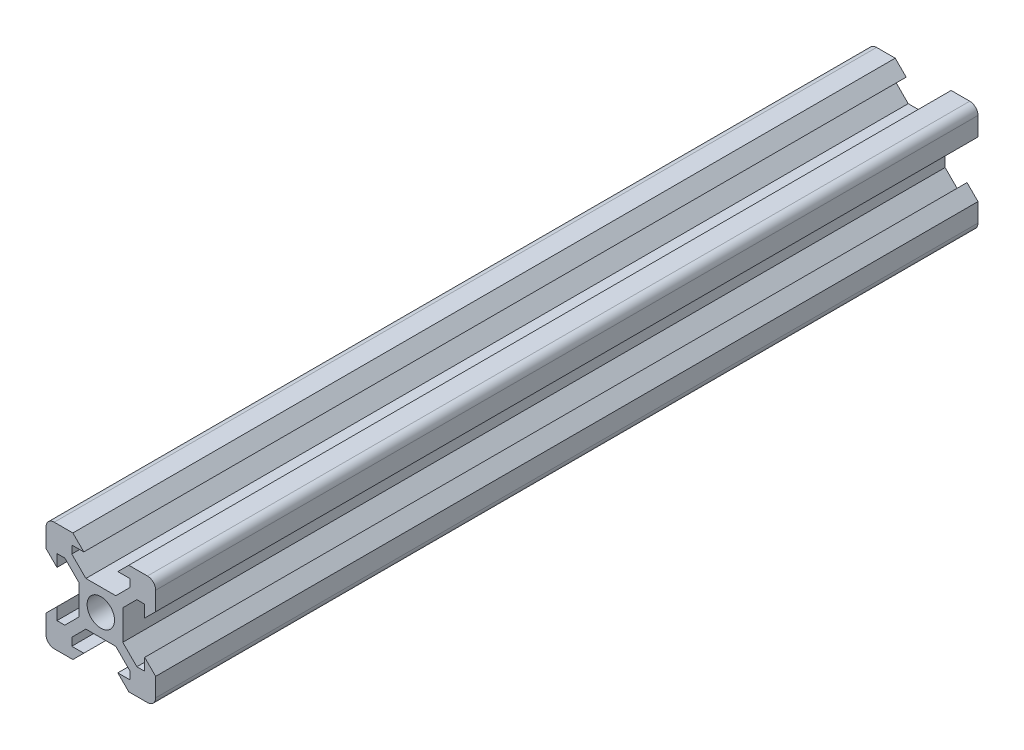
ISO-10303-21;
HEADER;
FILE_DESCRIPTION(('STEP AP214'),'2;1');
FILE_NAME('part.step','',(''),(''),'','','');
FILE_SCHEMA(('AUTOMOTIVE_DESIGN { 1 0 10303 214 1 1 1 1 }'));
ENDSEC;
DATA;
#1=APPLICATION_CONTEXT('core data for automotive mechanical design processes');
#2=APPLICATION_PROTOCOL_DEFINITION('international standard','automotive_design',2000,#1);
#3=PRODUCT_CONTEXT('',#1,'mechanical');
#4=PRODUCT('Part','Part','',(#3));
#5=PRODUCT_RELATED_PRODUCT_CATEGORY('part','',(#4));
#6=PRODUCT_DEFINITION_FORMATION('','',#4);
#7=PRODUCT_DEFINITION_CONTEXT('part definition',#1,'design');
#8=PRODUCT_DEFINITION('design','',#6,#7);
#9=PRODUCT_DEFINITION_SHAPE('','',#8);
#10=(LENGTH_UNIT() NAMED_UNIT(*) SI_UNIT(.MILLI.,.METRE.));
#11=(NAMED_UNIT(*) PLANE_ANGLE_UNIT() SI_UNIT($,.RADIAN.));
#12=(NAMED_UNIT(*) SI_UNIT($,.STERADIAN.) SOLID_ANGLE_UNIT());
#13=UNCERTAINTY_MEASURE_WITH_UNIT(LENGTH_MEASURE(1.E-05),#10,'distance_accuracy_value','');
#14=(GEOMETRIC_REPRESENTATION_CONTEXT(3) GLOBAL_UNCERTAINTY_ASSIGNED_CONTEXT((#13)) GLOBAL_UNIT_ASSIGNED_CONTEXT((#10,
#11,#12)) REPRESENTATION_CONTEXT('',''));
#15=CARTESIAN_POINT('',(0.,0.,0.));
#16=DIRECTION('',(0.,0.,1.));
#17=DIRECTION('',(1.,0.,0.));
#18=AXIS2_PLACEMENT_3D('',#15,#16,#17);
#19=CARTESIAN_POINT('',(0.,0.,150.));
#20=DIRECTION('',(0.,0.,1.));
#21=DIRECTION('',(1.,0.,0.));
#22=AXIS2_PLACEMENT_3D('',#19,#20,#21);
#23=PLANE('',#22);
#24=DIRECTION('',(0.,-1.,0.));
#25=VECTOR('',#24,1.);
#26=CARTESIAN_POINT('',(-10.,-5.1,150.));
#27=LINE('',#26,#25);
#28=CARTESIAN_POINT('',(-10.,-5.1,150.));
#29=VERTEX_POINT('',#28);
#30=CARTESIAN_POINT('',(-10.,-8.5,150.));
#31=VERTEX_POINT('',#30);
#32=EDGE_CURVE('E663',#29,#31,#27,.T.);
#33=ORIENTED_EDGE('',*,*,#32,.T.);
#34=CARTESIAN_POINT('',(-8.5,-8.5,150.));
#35=DIRECTION('',(0.,0.,1.));
#36=DIRECTION('',(1.,0.,0.));
#37=AXIS2_PLACEMENT_3D('',#34,#35,#36);
#38=CIRCLE('',#37,1.5);
#39=CARTESIAN_POINT('',(-8.5,-10.,150.));
#40=VERTEX_POINT('',#39);
#41=EDGE_CURVE('E389',#31,#40,#38,.T.);
#42=ORIENTED_EDGE('',*,*,#41,.T.);
#43=DIRECTION('',(1.,0.,0.));
#44=VECTOR('',#43,1.);
#45=CARTESIAN_POINT('',(-5.10000000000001,-10.,150.));
#46=LINE('',#45,#44);
#47=CARTESIAN_POINT('',(-5.10000000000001,-10.,150.));
#48=VERTEX_POINT('',#47);
#49=EDGE_CURVE('E665',#40,#48,#46,.T.);
#50=ORIENTED_EDGE('',*,*,#49,.T.);
#51=DIRECTION('',(0.707106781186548,0.707106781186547,0.));
#52=VECTOR('',#51,1.);
#53=CARTESIAN_POINT('',(-3.1,-8.,150.));
#54=LINE('',#53,#52);
#55=CARTESIAN_POINT('',(-3.1,-8.,150.));
#56=VERTEX_POINT('',#55);
#57=EDGE_CURVE('E667',#48,#56,#54,.T.);
#58=ORIENTED_EDGE('',*,*,#57,.T.);
#59=DIRECTION('',(-1.,0.,0.));
#60=VECTOR('',#59,1.);
#61=CARTESIAN_POINT('',(-5.3,-8.,150.));
#62=LINE('',#61,#60);
#63=CARTESIAN_POINT('',(-5.3,-8.,150.));
#64=VERTEX_POINT('',#63);
#65=EDGE_CURVE('E669',#56,#64,#62,.T.);
#66=ORIENTED_EDGE('',*,*,#65,.T.);
#67=DIRECTION('',(0.,1.,0.));
#68=VECTOR('',#67,1.);
#69=CARTESIAN_POINT('',(-5.3,-6.57279220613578,150.));
#70=LINE('',#69,#68);
#71=CARTESIAN_POINT('',(-5.3,-6.57279220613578,150.));
#72=VERTEX_POINT('',#71);
#73=EDGE_CURVE('E671',#64,#72,#70,.T.);
#74=ORIENTED_EDGE('',*,*,#73,.T.);
#75=DIRECTION('',(0.707106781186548,0.707106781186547,0.));
#76=VECTOR('',#75,1.);
#77=CARTESIAN_POINT('',(-2.72720779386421,-4.,150.));
#78=LINE('',#77,#76);
#79=CARTESIAN_POINT('',(-2.72720779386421,-4.,150.));
#80=VERTEX_POINT('',#79);
#81=EDGE_CURVE('E673',#72,#80,#78,.T.);
#82=ORIENTED_EDGE('',*,*,#81,.T.);
#83=DIRECTION('',(1.,0.,0.));
#84=VECTOR('',#83,1.);
#85=CARTESIAN_POINT('',(-2.72720779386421,-4.,150.));
#86=LINE('',#85,#84);
#87=CARTESIAN_POINT('',(2.72720779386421,-4.,150.));
#88=VERTEX_POINT('',#87);
#89=EDGE_CURVE('E675',#80,#88,#86,.T.);
#90=ORIENTED_EDGE('',*,*,#89,.T.);
#91=DIRECTION('',(0.707106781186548,-0.707106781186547,0.));
#92=VECTOR('',#91,1.);
#93=CARTESIAN_POINT('',(2.72720779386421,-4.,150.));
#94=LINE('',#93,#92);
#95=CARTESIAN_POINT('',(5.3,-6.57279220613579,150.));
#96=VERTEX_POINT('',#95);
#97=EDGE_CURVE('E677',#88,#96,#94,.T.);
#98=ORIENTED_EDGE('',*,*,#97,.T.);
#99=DIRECTION('',(0.,-1.,0.));
#100=VECTOR('',#99,1.);
#101=CARTESIAN_POINT('',(5.3,-6.57279220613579,150.));
#102=LINE('',#101,#100);
#103=CARTESIAN_POINT('',(5.3,-8.,150.));
#104=VERTEX_POINT('',#103);
#105=EDGE_CURVE('E679',#96,#104,#102,.T.);
#106=ORIENTED_EDGE('',*,*,#105,.T.);
#107=DIRECTION('',(-1.,0.,0.));
#108=VECTOR('',#107,1.);
#109=CARTESIAN_POINT('',(5.3,-8.,150.));
#110=LINE('',#109,#108);
#111=CARTESIAN_POINT('',(3.1,-8.,150.));
#112=VERTEX_POINT('',#111);
#113=EDGE_CURVE('E681',#104,#112,#110,.T.);
#114=ORIENTED_EDGE('',*,*,#113,.T.);
#115=DIRECTION('',(0.707106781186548,-0.707106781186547,0.));
#116=VECTOR('',#115,1.);
#117=CARTESIAN_POINT('',(3.1,-8.,150.));
#118=LINE('',#117,#116);
#119=CARTESIAN_POINT('',(5.1,-10.,150.));
#120=VERTEX_POINT('',#119);
#121=EDGE_CURVE('E683',#112,#120,#118,.T.);
#122=ORIENTED_EDGE('',*,*,#121,.T.);
#123=DIRECTION('',(1.,0.,0.));
#124=VECTOR('',#123,1.);
#125=CARTESIAN_POINT('',(5.1,-10.,150.));
#126=LINE('',#125,#124);
#127=CARTESIAN_POINT('',(8.5,-10.,150.));
#128=VERTEX_POINT('',#127);
#129=EDGE_CURVE('E685',#120,#128,#126,.T.);
#130=ORIENTED_EDGE('',*,*,#129,.T.);
#131=CARTESIAN_POINT('',(8.5,-8.5,150.));
#132=DIRECTION('',(0.,0.,1.));
#133=DIRECTION('',(1.,0.,0.));
#134=AXIS2_PLACEMENT_3D('',#131,#132,#133);
#135=CIRCLE('',#134,1.5);
#136=CARTESIAN_POINT('',(10.,-8.5,150.));
#137=VERTEX_POINT('',#136);
#138=EDGE_CURVE('E50',#128,#137,#135,.T.);
#139=ORIENTED_EDGE('',*,*,#138,.T.);
#140=DIRECTION('',(0.,1.,0.));
#141=VECTOR('',#140,1.);
#142=CARTESIAN_POINT('',(10.,-5.10000000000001,150.));
#143=LINE('',#142,#141);
#144=CARTESIAN_POINT('',(10.,-5.10000000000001,150.));
#145=VERTEX_POINT('',#144);
#146=EDGE_CURVE('E687',#137,#145,#143,.T.);
#147=ORIENTED_EDGE('',*,*,#146,.T.);
#148=DIRECTION('',(-0.707106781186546,0.707106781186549,0.));
#149=VECTOR('',#148,1.);
#150=CARTESIAN_POINT('',(8.,-3.1,150.));
#151=LINE('',#150,#149);
#152=CARTESIAN_POINT('',(8.,-3.1,150.));
#153=VERTEX_POINT('',#152);
#154=EDGE_CURVE('E689',#145,#153,#151,.T.);
#155=ORIENTED_EDGE('',*,*,#154,.T.);
#156=DIRECTION('',(0.,-1.,0.));
#157=VECTOR('',#156,1.);
#158=CARTESIAN_POINT('',(8.,-5.3,150.));
#159=LINE('',#158,#157);
#160=CARTESIAN_POINT('',(8.,-5.3,150.));
#161=VERTEX_POINT('',#160);
#162=EDGE_CURVE('E691',#153,#161,#159,.T.);
#163=ORIENTED_EDGE('',*,*,#162,.T.);
#164=DIRECTION('',(-1.,0.,0.));
#165=VECTOR('',#164,1.);
#166=CARTESIAN_POINT('',(6.57279220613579,-5.3,150.));
#167=LINE('',#166,#165);
#168=CARTESIAN_POINT('',(6.57279220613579,-5.3,150.));
#169=VERTEX_POINT('',#168);
#170=EDGE_CURVE('E693',#161,#169,#167,.T.);
#171=ORIENTED_EDGE('',*,*,#170,.T.);
#172=DIRECTION('',(-0.707106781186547,0.707106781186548,0.));
#173=VECTOR('',#172,1.);
#174=CARTESIAN_POINT('',(4.,-2.72720779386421,150.));
#175=LINE('',#174,#173);
#176=CARTESIAN_POINT('',(4.,-2.72720779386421,150.));
#177=VERTEX_POINT('',#176);
#178=EDGE_CURVE('E695',#169,#177,#175,.T.);
#179=ORIENTED_EDGE('',*,*,#178,.T.);
#180=DIRECTION('',(0.,1.,0.));
#181=VECTOR('',#180,1.);
#182=CARTESIAN_POINT('',(4.,2.72720779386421,150.));
#183=LINE('',#182,#181);
#184=CARTESIAN_POINT('',(4.,2.72720779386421,150.));
#185=VERTEX_POINT('',#184);
#186=EDGE_CURVE('E357',#177,#185,#183,.T.);
#187=ORIENTED_EDGE('',*,*,#186,.T.);
#188=DIRECTION('',(0.707106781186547,0.707106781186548,0.));
#189=VECTOR('',#188,1.);
#190=CARTESIAN_POINT('',(4.,2.72720779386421,150.));
#191=LINE('',#190,#189);
#192=CARTESIAN_POINT('',(6.57279220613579,5.3,150.));
#193=VERTEX_POINT('',#192);
#194=EDGE_CURVE('E351',#185,#193,#191,.T.);
#195=ORIENTED_EDGE('',*,*,#194,.T.);
#196=DIRECTION('',(1.,0.,0.));
#197=VECTOR('',#196,1.);
#198=CARTESIAN_POINT('',(6.57279220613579,5.3,150.));
#199=LINE('',#198,#197);
#200=CARTESIAN_POINT('',(8.,5.3,150.));
#201=VERTEX_POINT('',#200);
#202=EDGE_CURVE('E341',#193,#201,#199,.T.);
#203=ORIENTED_EDGE('',*,*,#202,.T.);
#204=DIRECTION('',(0.,-1.,0.));
#205=VECTOR('',#204,1.);
#206=CARTESIAN_POINT('',(8.,5.3,150.));
#207=LINE('',#206,#205);
#208=CARTESIAN_POINT('',(8.,3.1,150.));
#209=VERTEX_POINT('',#208);
#210=EDGE_CURVE('E350',#201,#209,#207,.T.);
#211=ORIENTED_EDGE('',*,*,#210,.T.);
#212=DIRECTION('',(0.707106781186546,0.707106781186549,0.));
#213=VECTOR('',#212,1.);
#214=CARTESIAN_POINT('',(8.,3.1,150.));
#215=LINE('',#214,#213);
#216=CARTESIAN_POINT('',(10.,5.10000000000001,150.));
#217=VERTEX_POINT('',#216);
#218=EDGE_CURVE('E595',#209,#217,#215,.T.);
#219=ORIENTED_EDGE('',*,*,#218,.T.);
#220=DIRECTION('',(0.,1.,0.));
#221=VECTOR('',#220,1.);
#222=CARTESIAN_POINT('',(10.,5.10000000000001,150.));
#223=LINE('',#222,#221);
#224=CARTESIAN_POINT('',(10.,8.5,150.));
#225=VERTEX_POINT('',#224);
#226=EDGE_CURVE('E701',#217,#225,#223,.T.);
#227=ORIENTED_EDGE('',*,*,#226,.T.);
#228=CARTESIAN_POINT('',(8.5,8.5,150.));
#229=DIRECTION('',(0.,0.,1.));
#230=DIRECTION('',(1.,0.,0.));
#231=AXIS2_PLACEMENT_3D('',#228,#229,#230);
#232=CIRCLE('',#231,1.5);
#233=CARTESIAN_POINT('',(8.5,10.,150.));
#234=VERTEX_POINT('',#233);
#235=EDGE_CURVE('E386',#225,#234,#232,.T.);
#236=ORIENTED_EDGE('',*,*,#235,.T.);
#237=DIRECTION('',(-1.,0.,0.));
#238=VECTOR('',#237,1.);
#239=CARTESIAN_POINT('',(5.1,10.,150.));
#240=LINE('',#239,#238);
#241=CARTESIAN_POINT('',(5.1,10.,150.));
#242=VERTEX_POINT('',#241);
#243=EDGE_CURVE('E706',#234,#242,#240,.T.);
#244=ORIENTED_EDGE('',*,*,#243,.T.);
#245=DIRECTION('',(-0.707106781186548,-0.707106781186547,0.));
#246=VECTOR('',#245,1.);
#247=CARTESIAN_POINT('',(3.1,8.,150.));
#248=LINE('',#247,#246);
#249=CARTESIAN_POINT('',(3.1,8.,150.));
#250=VERTEX_POINT('',#249);
#251=EDGE_CURVE('E708',#242,#250,#248,.T.);
#252=ORIENTED_EDGE('',*,*,#251,.T.);
#253=DIRECTION('',(1.,0.,0.));
#254=VECTOR('',#253,1.);
#255=CARTESIAN_POINT('',(5.3,8.,150.));
#256=LINE('',#255,#254);
#257=CARTESIAN_POINT('',(5.3,8.,150.));
#258=VERTEX_POINT('',#257);
#259=EDGE_CURVE('E710',#250,#258,#256,.T.);
#260=ORIENTED_EDGE('',*,*,#259,.T.);
#261=DIRECTION('',(0.,-1.,0.));
#262=VECTOR('',#261,1.);
#263=CARTESIAN_POINT('',(5.3,6.57279220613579,150.));
#264=LINE('',#263,#262);
#265=CARTESIAN_POINT('',(5.3,6.57279220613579,150.));
#266=VERTEX_POINT('',#265);
#267=EDGE_CURVE('E712',#258,#266,#264,.T.);
#268=ORIENTED_EDGE('',*,*,#267,.T.);
#269=DIRECTION('',(-0.707106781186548,-0.707106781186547,0.));
#270=VECTOR('',#269,1.);
#271=CARTESIAN_POINT('',(2.72720779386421,4.,150.));
#272=LINE('',#271,#270);
#273=CARTESIAN_POINT('',(2.72720779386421,4.,150.));
#274=VERTEX_POINT('',#273);
#275=EDGE_CURVE('E714',#266,#274,#272,.T.);
#276=ORIENTED_EDGE('',*,*,#275,.T.);
#277=DIRECTION('',(-1.,0.,0.));
#278=VECTOR('',#277,1.);
#279=CARTESIAN_POINT('',(-2.72720779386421,4.,150.));
#280=LINE('',#279,#278);
#281=CARTESIAN_POINT('',(-2.72720779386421,4.,150.));
#282=VERTEX_POINT('',#281);
#283=EDGE_CURVE('E716',#274,#282,#280,.T.);
#284=ORIENTED_EDGE('',*,*,#283,.T.);
#285=DIRECTION('',(-0.707106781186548,0.707106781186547,0.));
#286=VECTOR('',#285,1.);
#287=CARTESIAN_POINT('',(-2.72720779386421,4.,150.));
#288=LINE('',#287,#286);
#289=CARTESIAN_POINT('',(-5.3,6.57279220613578,150.));
#290=VERTEX_POINT('',#289);
#291=EDGE_CURVE('E718',#282,#290,#288,.T.);
#292=ORIENTED_EDGE('',*,*,#291,.T.);
#293=DIRECTION('',(0.,1.,0.));
#294=VECTOR('',#293,1.);
#295=CARTESIAN_POINT('',(-5.3,6.57279220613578,150.));
#296=LINE('',#295,#294);
#297=CARTESIAN_POINT('',(-5.3,8.,150.));
#298=VERTEX_POINT('',#297);
#299=EDGE_CURVE('E720',#290,#298,#296,.T.);
#300=ORIENTED_EDGE('',*,*,#299,.T.);
#301=DIRECTION('',(1.,0.,0.));
#302=VECTOR('',#301,1.);
#303=CARTESIAN_POINT('',(-5.3,8.,150.));
#304=LINE('',#303,#302);
#305=CARTESIAN_POINT('',(-3.1,8.,150.));
#306=VERTEX_POINT('',#305);
#307=EDGE_CURVE('E642',#298,#306,#304,.T.);
#308=ORIENTED_EDGE('',*,*,#307,.T.);
#309=DIRECTION('',(-0.707106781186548,0.707106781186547,0.));
#310=VECTOR('',#309,1.);
#311=CARTESIAN_POINT('',(-3.1,8.,150.));
#312=LINE('',#311,#310);
#313=CARTESIAN_POINT('',(-5.1,10.,150.));
#314=VERTEX_POINT('',#313);
#315=EDGE_CURVE('E638',#306,#314,#312,.T.);
#316=ORIENTED_EDGE('',*,*,#315,.T.);
#317=DIRECTION('',(-1.,0.,0.));
#318=VECTOR('',#317,1.);
#319=CARTESIAN_POINT('',(-5.1,10.,150.));
#320=LINE('',#319,#318);
#321=CARTESIAN_POINT('',(-8.5,10.,150.));
#322=VERTEX_POINT('',#321);
#323=EDGE_CURVE('E637',#314,#322,#320,.T.);
#324=ORIENTED_EDGE('',*,*,#323,.T.);
#325=CARTESIAN_POINT('',(-8.5,8.5,150.));
#326=DIRECTION('',(0.,0.,1.));
#327=DIRECTION('',(1.,0.,0.));
#328=AXIS2_PLACEMENT_3D('',#325,#326,#327);
#329=CIRCLE('',#328,1.5);
#330=CARTESIAN_POINT('',(-10.,8.5,150.));
#331=VERTEX_POINT('',#330);
#332=EDGE_CURVE('E384',#322,#331,#329,.T.);
#333=ORIENTED_EDGE('',*,*,#332,.T.);
#334=DIRECTION('',(0.,-1.,0.));
#335=VECTOR('',#334,1.);
#336=CARTESIAN_POINT('',(-10.,5.1,150.));
#337=LINE('',#336,#335);
#338=CARTESIAN_POINT('',(-10.,5.1,150.));
#339=VERTEX_POINT('',#338);
#340=EDGE_CURVE('E408',#331,#339,#337,.T.);
#341=ORIENTED_EDGE('',*,*,#340,.T.);
#342=DIRECTION('',(0.707106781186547,-0.707106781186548,0.));
#343=VECTOR('',#342,1.);
#344=CARTESIAN_POINT('',(-8.,3.1,150.));
#345=LINE('',#344,#343);
#346=CARTESIAN_POINT('',(-8.,3.1,150.));
#347=VERTEX_POINT('',#346);
#348=EDGE_CURVE('E640',#339,#347,#345,.T.);
#349=ORIENTED_EDGE('',*,*,#348,.T.);
#350=DIRECTION('',(0.,1.,0.));
#351=VECTOR('',#350,1.);
#352=CARTESIAN_POINT('',(-8.,5.3,150.));
#353=LINE('',#352,#351);
#354=CARTESIAN_POINT('',(-8.,5.3,150.));
#355=VERTEX_POINT('',#354);
#356=EDGE_CURVE('E647',#347,#355,#353,.T.);
#357=ORIENTED_EDGE('',*,*,#356,.T.);
#358=DIRECTION('',(1.,0.,0.));
#359=VECTOR('',#358,1.);
#360=CARTESIAN_POINT('',(-6.57279220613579,5.3,150.));
#361=LINE('',#360,#359);
#362=CARTESIAN_POINT('',(-6.57279220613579,5.3,150.));
#363=VERTEX_POINT('',#362);
#364=EDGE_CURVE('E649',#355,#363,#361,.T.);
#365=ORIENTED_EDGE('',*,*,#364,.T.);
#366=DIRECTION('',(0.707106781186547,-0.707106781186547,0.));
#367=VECTOR('',#366,1.);
#368=CARTESIAN_POINT('',(-4.,2.72720779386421,150.));
#369=LINE('',#368,#367);
#370=CARTESIAN_POINT('',(-4.,2.72720779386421,150.));
#371=VERTEX_POINT('',#370);
#372=EDGE_CURVE('E651',#363,#371,#369,.T.);
#373=ORIENTED_EDGE('',*,*,#372,.T.);
#374=DIRECTION('',(0.,-1.,0.));
#375=VECTOR('',#374,1.);
#376=CARTESIAN_POINT('',(-4.,2.72720779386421,150.));
#377=LINE('',#376,#375);
#378=CARTESIAN_POINT('',(-4.,-2.72720779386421,150.));
#379=VERTEX_POINT('',#378);
#380=EDGE_CURVE('E653',#371,#379,#377,.T.);
#381=ORIENTED_EDGE('',*,*,#380,.T.);
#382=DIRECTION('',(-0.707106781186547,-0.707106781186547,0.));
#383=VECTOR('',#382,1.);
#384=CARTESIAN_POINT('',(-4.,-2.72720779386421,150.));
#385=LINE('',#384,#383);
#386=CARTESIAN_POINT('',(-6.57279220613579,-5.3,150.));
#387=VERTEX_POINT('',#386);
#388=EDGE_CURVE('E655',#379,#387,#385,.T.);
#389=ORIENTED_EDGE('',*,*,#388,.T.);
#390=DIRECTION('',(-1.,0.,0.));
#391=VECTOR('',#390,1.);
#392=CARTESIAN_POINT('',(-6.57279220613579,-5.3,150.));
#393=LINE('',#392,#391);
#394=CARTESIAN_POINT('',(-8.,-5.3,150.));
#395=VERTEX_POINT('',#394);
#396=EDGE_CURVE('E657',#387,#395,#393,.T.);
#397=ORIENTED_EDGE('',*,*,#396,.T.);
#398=DIRECTION('',(0.,1.,0.));
#399=VECTOR('',#398,1.);
#400=CARTESIAN_POINT('',(-8.,-5.3,150.));
#401=LINE('',#400,#399);
#402=CARTESIAN_POINT('',(-8.,-3.1,150.));
#403=VERTEX_POINT('',#402);
#404=EDGE_CURVE('E659',#395,#403,#401,.T.);
#405=ORIENTED_EDGE('',*,*,#404,.T.);
#406=DIRECTION('',(-0.707106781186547,-0.707106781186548,0.));
#407=VECTOR('',#406,1.);
#408=CARTESIAN_POINT('',(-8.,-3.1,150.));
#409=LINE('',#408,#407);
#410=EDGE_CURVE('E661',#403,#29,#409,.T.);
#411=ORIENTED_EDGE('',*,*,#410,.T.);
#412=EDGE_LOOP('',(#33,#42,#50,#58,#66,#74,#82,#90,#98,#106,#114,#122,#130,#139,#147,#155,#163,
#171,#179,#187,#195,#203,#211,#219,#227,#236,#244,#252,#260,#268,#276,#284,#292,#300,#308,#316,
#324,#333,#341,#349,#357,#365,#373,#381,#389,#397,#405,#411));
#413=FACE_BOUND('',#412,.T.);
#414=CARTESIAN_POINT('',(0.,0.,150.));
#415=DIRECTION('',(0.,0.,1.));
#416=DIRECTION('',(1.,0.,0.));
#417=AXIS2_PLACEMENT_3D('',#414,#415,#416);
#418=CIRCLE('',#417,2.5);
#419=CARTESIAN_POINT('',(2.5,0.,150.));
#420=VERTEX_POINT('',#419);
#421=EDGE_CURVE('E698',#420,#420,#418,.T.);
#422=ORIENTED_EDGE('',*,*,#421,.F.);
#423=EDGE_LOOP('',(#422));
#424=FACE_BOUND('',#423,.T.);
#425=ADVANCED_FACE('F35',(#413,#424),#23,.T.);
#426=CARTESIAN_POINT('',(0.,0.,0.));
#427=DIRECTION('',(0.,0.,1.));
#428=DIRECTION('',(1.,0.,0.));
#429=AXIS2_PLACEMENT_3D('',#426,#427,#428);
#430=PLANE('',#429);
#431=DIRECTION('',(1.,0.,0.));
#432=VECTOR('',#431,1.);
#433=CARTESIAN_POINT('',(-5.10000000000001,-10.,0.));
#434=LINE('',#433,#432);
#435=CARTESIAN_POINT('',(-8.5,-10.,0.));
#436=VERTEX_POINT('',#435);
#437=CARTESIAN_POINT('',(-5.10000000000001,-10.,0.));
#438=VERTEX_POINT('',#437);
#439=EDGE_CURVE('E446',#436,#438,#434,.T.);
#440=ORIENTED_EDGE('',*,*,#439,.F.);
#441=CARTESIAN_POINT('',(-8.5,-8.5,0.));
#442=DIRECTION('',(0.,0.,1.));
#443=DIRECTION('',(1.,0.,0.));
#444=AXIS2_PLACEMENT_3D('',#441,#442,#443);
#445=CIRCLE('',#444,1.5);
#446=CARTESIAN_POINT('',(-10.,-8.5,0.));
#447=VERTEX_POINT('',#446);
#448=EDGE_CURVE('E380',#436,#447,#445,.F.);
#449=ORIENTED_EDGE('',*,*,#448,.T.);
#450=DIRECTION('',(0.,-1.,0.));
#451=VECTOR('',#450,1.);
#452=CARTESIAN_POINT('',(-10.,-5.1,0.));
#453=LINE('',#452,#451);
#454=CARTESIAN_POINT('',(-10.,-5.1,0.));
#455=VERTEX_POINT('',#454);
#456=EDGE_CURVE('E443',#455,#447,#453,.T.);
#457=ORIENTED_EDGE('',*,*,#456,.F.);
#458=DIRECTION('',(-0.707106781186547,-0.707106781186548,0.));
#459=VECTOR('',#458,1.);
#460=CARTESIAN_POINT('',(-8.,-3.1,0.));
#461=LINE('',#460,#459);
#462=CARTESIAN_POINT('',(-8.,-3.1,0.));
#463=VERTEX_POINT('',#462);
#464=EDGE_CURVE('E441',#463,#455,#461,.T.);
#465=ORIENTED_EDGE('',*,*,#464,.F.);
#466=DIRECTION('',(0.,1.,0.));
#467=VECTOR('',#466,1.);
#468=CARTESIAN_POINT('',(-8.,-5.3,0.));
#469=LINE('',#468,#467);
#470=CARTESIAN_POINT('',(-8.,-5.3,0.));
#471=VERTEX_POINT('',#470);
#472=EDGE_CURVE('E439',#471,#463,#469,.T.);
#473=ORIENTED_EDGE('',*,*,#472,.F.);
#474=DIRECTION('',(-1.,0.,0.));
#475=VECTOR('',#474,1.);
#476=CARTESIAN_POINT('',(-6.57279220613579,-5.3,0.));
#477=LINE('',#476,#475);
#478=CARTESIAN_POINT('',(-6.57279220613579,-5.3,0.));
#479=VERTEX_POINT('',#478);
#480=EDGE_CURVE('E437',#479,#471,#477,.T.);
#481=ORIENTED_EDGE('',*,*,#480,.F.);
#482=DIRECTION('',(-0.707106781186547,-0.707106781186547,0.));
#483=VECTOR('',#482,1.);
#484=CARTESIAN_POINT('',(-4.,-2.72720779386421,0.));
#485=LINE('',#484,#483);
#486=CARTESIAN_POINT('',(-4.,-2.72720779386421,0.));
#487=VERTEX_POINT('',#486);
#488=EDGE_CURVE('E435',#487,#479,#485,.T.);
#489=ORIENTED_EDGE('',*,*,#488,.F.);
#490=DIRECTION('',(0.,-1.,0.));
#491=VECTOR('',#490,1.);
#492=CARTESIAN_POINT('',(-4.,2.72720779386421,0.));
#493=LINE('',#492,#491);
#494=CARTESIAN_POINT('',(-4.,2.72720779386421,0.));
#495=VERTEX_POINT('',#494);
#496=EDGE_CURVE('E433',#495,#487,#493,.T.);
#497=ORIENTED_EDGE('',*,*,#496,.F.);
#498=DIRECTION('',(0.707106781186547,-0.707106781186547,0.));
#499=VECTOR('',#498,1.);
#500=CARTESIAN_POINT('',(-4.,2.72720779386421,0.));
#501=LINE('',#500,#499);
#502=CARTESIAN_POINT('',(-6.57279220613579,5.3,0.));
#503=VERTEX_POINT('',#502);
#504=EDGE_CURVE('E431',#503,#495,#501,.T.);
#505=ORIENTED_EDGE('',*,*,#504,.F.);
#506=DIRECTION('',(1.,0.,0.));
#507=VECTOR('',#506,1.);
#508=CARTESIAN_POINT('',(-6.57279220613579,5.3,0.));
#509=LINE('',#508,#507);
#510=CARTESIAN_POINT('',(-8.,5.3,0.));
#511=VERTEX_POINT('',#510);
#512=EDGE_CURVE('E429',#511,#503,#509,.T.);
#513=ORIENTED_EDGE('',*,*,#512,.F.);
#514=DIRECTION('',(0.,1.,0.));
#515=VECTOR('',#514,1.);
#516=CARTESIAN_POINT('',(-8.,5.3,0.));
#517=LINE('',#516,#515);
#518=CARTESIAN_POINT('',(-8.,3.1,0.));
#519=VERTEX_POINT('',#518);
#520=EDGE_CURVE('E422',#519,#511,#517,.T.);
#521=ORIENTED_EDGE('',*,*,#520,.F.);
#522=DIRECTION('',(0.707106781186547,-0.707106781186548,0.));
#523=VECTOR('',#522,1.);
#524=CARTESIAN_POINT('',(-8.,3.1,0.));
#525=LINE('',#524,#523);
#526=CARTESIAN_POINT('',(-10.,5.1,0.));
#527=VERTEX_POINT('',#526);
#528=EDGE_CURVE('E419',#527,#519,#525,.T.);
#529=ORIENTED_EDGE('',*,*,#528,.F.);
#530=DIRECTION('',(0.,-1.,0.));
#531=VECTOR('',#530,1.);
#532=CARTESIAN_POINT('',(-10.,5.1,0.));
#533=LINE('',#532,#531);
#534=CARTESIAN_POINT('',(-10.,8.5,0.));
#535=VERTEX_POINT('',#534);
#536=EDGE_CURVE('E406',#535,#527,#533,.T.);
#537=ORIENTED_EDGE('',*,*,#536,.F.);
#538=CARTESIAN_POINT('',(-8.5,8.5,0.));
#539=DIRECTION('',(0.,0.,1.));
#540=DIRECTION('',(1.,0.,0.));
#541=AXIS2_PLACEMENT_3D('',#538,#539,#540);
#542=CIRCLE('',#541,1.5);
#543=CARTESIAN_POINT('',(-8.5,10.,0.));
#544=VERTEX_POINT('',#543);
#545=EDGE_CURVE('E369',#535,#544,#542,.F.);
#546=ORIENTED_EDGE('',*,*,#545,.T.);
#547=DIRECTION('',(-1.,0.,0.));
#548=VECTOR('',#547,1.);
#549=CARTESIAN_POINT('',(-5.1,10.,0.));
#550=LINE('',#549,#548);
#551=CARTESIAN_POINT('',(-5.1,10.,0.));
#552=VERTEX_POINT('',#551);
#553=EDGE_CURVE('E420',#552,#544,#550,.T.);
#554=ORIENTED_EDGE('',*,*,#553,.F.);
#555=DIRECTION('',(-0.707106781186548,0.707106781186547,0.));
#556=VECTOR('',#555,1.);
#557=CARTESIAN_POINT('',(-3.1,8.,0.));
#558=LINE('',#557,#556);
#559=CARTESIAN_POINT('',(-3.1,8.,0.));
#560=VERTEX_POINT('',#559);
#561=EDGE_CURVE('E424',#560,#552,#558,.T.);
#562=ORIENTED_EDGE('',*,*,#561,.F.);
#563=DIRECTION('',(1.,0.,0.));
#564=VECTOR('',#563,1.);
#565=CARTESIAN_POINT('',(-5.3,8.,0.));
#566=LINE('',#565,#564);
#567=CARTESIAN_POINT('',(-5.3,8.,0.));
#568=VERTEX_POINT('',#567);
#569=EDGE_CURVE('E624',#568,#560,#566,.T.);
#570=ORIENTED_EDGE('',*,*,#569,.F.);
#571=DIRECTION('',(0.,1.,0.));
#572=VECTOR('',#571,1.);
#573=CARTESIAN_POINT('',(-5.3,6.57279220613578,0.));
#574=LINE('',#573,#572);
#575=CARTESIAN_POINT('',(-5.3,6.57279220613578,0.));
#576=VERTEX_POINT('',#575);
#577=EDGE_CURVE('E622',#576,#568,#574,.T.);
#578=ORIENTED_EDGE('',*,*,#577,.F.);
#579=DIRECTION('',(-0.707106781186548,0.707106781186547,0.));
#580=VECTOR('',#579,1.);
#581=CARTESIAN_POINT('',(-2.72720779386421,4.,0.));
#582=LINE('',#581,#580);
#583=CARTESIAN_POINT('',(-2.72720779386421,4.,0.));
#584=VERTEX_POINT('',#583);
#585=EDGE_CURVE('E620',#584,#576,#582,.T.);
#586=ORIENTED_EDGE('',*,*,#585,.F.);
#587=DIRECTION('',(-1.,0.,0.));
#588=VECTOR('',#587,1.);
#589=CARTESIAN_POINT('',(-2.72720779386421,4.,0.));
#590=LINE('',#589,#588);
#591=CARTESIAN_POINT('',(2.72720779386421,4.,0.));
#592=VERTEX_POINT('',#591);
#593=EDGE_CURVE('E618',#592,#584,#590,.T.);
#594=ORIENTED_EDGE('',*,*,#593,.F.);
#595=DIRECTION('',(-0.707106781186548,-0.707106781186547,0.));
#596=VECTOR('',#595,1.);
#597=CARTESIAN_POINT('',(2.72720779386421,4.,0.));
#598=LINE('',#597,#596);
#599=CARTESIAN_POINT('',(5.3,6.57279220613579,0.));
#600=VERTEX_POINT('',#599);
#601=EDGE_CURVE('E616',#600,#592,#598,.T.);
#602=ORIENTED_EDGE('',*,*,#601,.F.);
#603=DIRECTION('',(0.,-1.,0.));
#604=VECTOR('',#603,1.);
#605=CARTESIAN_POINT('',(5.3,6.57279220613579,0.));
#606=LINE('',#605,#604);
#607=CARTESIAN_POINT('',(5.3,8.,0.));
#608=VERTEX_POINT('',#607);
#609=EDGE_CURVE('E614',#608,#600,#606,.T.);
#610=ORIENTED_EDGE('',*,*,#609,.F.);
#611=DIRECTION('',(1.,0.,0.));
#612=VECTOR('',#611,1.);
#613=CARTESIAN_POINT('',(5.3,8.,0.));
#614=LINE('',#613,#612);
#615=CARTESIAN_POINT('',(3.1,8.,0.));
#616=VERTEX_POINT('',#615);
#617=EDGE_CURVE('E612',#616,#608,#614,.T.);
#618=ORIENTED_EDGE('',*,*,#617,.F.);
#619=DIRECTION('',(-0.707106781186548,-0.707106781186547,0.));
#620=VECTOR('',#619,1.);
#621=CARTESIAN_POINT('',(3.1,8.,0.));
#622=LINE('',#621,#620);
#623=CARTESIAN_POINT('',(5.1,10.,0.));
#624=VERTEX_POINT('',#623);
#625=EDGE_CURVE('E610',#624,#616,#622,.T.);
#626=ORIENTED_EDGE('',*,*,#625,.F.);
#627=DIRECTION('',(-1.,0.,0.));
#628=VECTOR('',#627,1.);
#629=CARTESIAN_POINT('',(5.1,10.,0.));
#630=LINE('',#629,#628);
#631=CARTESIAN_POINT('',(8.5,10.,0.));
#632=VERTEX_POINT('',#631);
#633=EDGE_CURVE('E603',#632,#624,#630,.T.);
#634=ORIENTED_EDGE('',*,*,#633,.F.);
#635=CARTESIAN_POINT('',(8.5,8.5,0.));
#636=DIRECTION('',(0.,0.,1.));
#637=DIRECTION('',(1.,0.,0.));
#638=AXIS2_PLACEMENT_3D('',#635,#636,#637);
#639=CIRCLE('',#638,1.5);
#640=CARTESIAN_POINT('',(10.,8.5,0.));
#641=VERTEX_POINT('',#640);
#642=EDGE_CURVE('E376',#632,#641,#639,.F.);
#643=ORIENTED_EDGE('',*,*,#642,.T.);
#644=DIRECTION('',(0.,1.,0.));
#645=VECTOR('',#644,1.);
#646=CARTESIAN_POINT('',(10.,5.10000000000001,0.));
#647=LINE('',#646,#645);
#648=CARTESIAN_POINT('',(10.,5.10000000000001,0.));
#649=VERTEX_POINT('',#648);
#650=EDGE_CURVE('E601',#649,#641,#647,.T.);
#651=ORIENTED_EDGE('',*,*,#650,.F.);
#652=DIRECTION('',(0.707106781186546,0.707106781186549,0.));
#653=VECTOR('',#652,1.);
#654=CARTESIAN_POINT('',(8.,3.1,0.));
#655=LINE('',#654,#653);
#656=CARTESIAN_POINT('',(8.,3.1,0.));
#657=VERTEX_POINT('',#656);
#658=EDGE_CURVE('E594',#657,#649,#655,.T.);
#659=ORIENTED_EDGE('',*,*,#658,.F.);
#660=DIRECTION('',(0.,-1.,0.));
#661=VECTOR('',#660,1.);
#662=CARTESIAN_POINT('',(8.,5.3,0.));
#663=LINE('',#662,#661);
#664=CARTESIAN_POINT('',(8.,5.3,0.));
#665=VERTEX_POINT('',#664);
#666=EDGE_CURVE('E599',#665,#657,#663,.T.);
#667=ORIENTED_EDGE('',*,*,#666,.F.);
#668=DIRECTION('',(1.,0.,0.));
#669=VECTOR('',#668,1.);
#670=CARTESIAN_POINT('',(6.57279220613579,5.3,0.));
#671=LINE('',#670,#669);
#672=CARTESIAN_POINT('',(6.57279220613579,5.3,0.));
#673=VERTEX_POINT('',#672);
#674=EDGE_CURVE('E605',#673,#665,#671,.T.);
#675=ORIENTED_EDGE('',*,*,#674,.F.);
#676=DIRECTION('',(0.707106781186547,0.707106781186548,0.));
#677=VECTOR('',#676,1.);
#678=CARTESIAN_POINT('',(4.,2.72720779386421,0.));
#679=LINE('',#678,#677);
#680=CARTESIAN_POINT('',(4.,2.72720779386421,0.));
#681=VERTEX_POINT('',#680);
#682=EDGE_CURVE('E365',#681,#673,#679,.T.);
#683=ORIENTED_EDGE('',*,*,#682,.F.);
#684=DIRECTION('',(0.,1.,0.));
#685=VECTOR('',#684,1.);
#686=CARTESIAN_POINT('',(4.,2.72720779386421,0.));
#687=LINE('',#686,#685);
#688=CARTESIAN_POINT('',(4.,-2.72720779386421,0.));
#689=VERTEX_POINT('',#688);
#690=EDGE_CURVE('E361',#689,#681,#687,.T.);
#691=ORIENTED_EDGE('',*,*,#690,.F.);
#692=DIRECTION('',(-0.707106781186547,0.707106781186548,0.));
#693=VECTOR('',#692,1.);
#694=CARTESIAN_POINT('',(4.,-2.72720779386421,0.));
#695=LINE('',#694,#693);
#696=CARTESIAN_POINT('',(6.57279220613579,-5.3,0.));
#697=VERTEX_POINT('',#696);
#698=EDGE_CURVE('E476',#697,#689,#695,.T.);
#699=ORIENTED_EDGE('',*,*,#698,.F.);
#700=DIRECTION('',(-1.,0.,0.));
#701=VECTOR('',#700,1.);
#702=CARTESIAN_POINT('',(6.57279220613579,-5.3,0.));
#703=LINE('',#702,#701);
#704=CARTESIAN_POINT('',(8.,-5.3,0.));
#705=VERTEX_POINT('',#704);
#706=EDGE_CURVE('E474',#705,#697,#703,.T.);
#707=ORIENTED_EDGE('',*,*,#706,.F.);
#708=DIRECTION('',(0.,-1.,0.));
#709=VECTOR('',#708,1.);
#710=CARTESIAN_POINT('',(8.,-5.3,0.));
#711=LINE('',#710,#709);
#712=CARTESIAN_POINT('',(8.,-3.1,0.));
#713=VERTEX_POINT('',#712);
#714=EDGE_CURVE('E472',#713,#705,#711,.T.);
#715=ORIENTED_EDGE('',*,*,#714,.F.);
#716=DIRECTION('',(-0.707106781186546,0.707106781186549,0.));
#717=VECTOR('',#716,1.);
#718=CARTESIAN_POINT('',(8.,-3.1,0.));
#719=LINE('',#718,#717);
#720=CARTESIAN_POINT('',(10.,-5.10000000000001,0.));
#721=VERTEX_POINT('',#720);
#722=EDGE_CURVE('E470',#721,#713,#719,.T.);
#723=ORIENTED_EDGE('',*,*,#722,.F.);
#724=DIRECTION('',(0.,1.,0.));
#725=VECTOR('',#724,1.);
#726=CARTESIAN_POINT('',(10.,-5.10000000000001,0.));
#727=LINE('',#726,#725);
#728=CARTESIAN_POINT('',(10.,-8.5,0.));
#729=VERTEX_POINT('',#728);
#730=EDGE_CURVE('E468',#729,#721,#727,.T.);
#731=ORIENTED_EDGE('',*,*,#730,.F.);
#732=CARTESIAN_POINT('',(8.5,-8.5,0.));
#733=DIRECTION('',(0.,0.,1.));
#734=DIRECTION('',(1.,0.,0.));
#735=AXIS2_PLACEMENT_3D('',#732,#733,#734);
#736=CIRCLE('',#735,1.5);
#737=CARTESIAN_POINT('',(8.5,-10.,0.));
#738=VERTEX_POINT('',#737);
#739=EDGE_CURVE('E378',#729,#738,#736,.F.);
#740=ORIENTED_EDGE('',*,*,#739,.T.);
#741=DIRECTION('',(1.,0.,0.));
#742=VECTOR('',#741,1.);
#743=CARTESIAN_POINT('',(5.1,-10.,0.));
#744=LINE('',#743,#742);
#745=CARTESIAN_POINT('',(5.1,-10.,0.));
#746=VERTEX_POINT('',#745);
#747=EDGE_CURVE('E466',#746,#738,#744,.T.);
#748=ORIENTED_EDGE('',*,*,#747,.F.);
#749=DIRECTION('',(0.707106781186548,-0.707106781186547,0.));
#750=VECTOR('',#749,1.);
#751=CARTESIAN_POINT('',(3.1,-8.,0.));
#752=LINE('',#751,#750);
#753=CARTESIAN_POINT('',(3.1,-8.,0.));
#754=VERTEX_POINT('',#753);
#755=EDGE_CURVE('E464',#754,#746,#752,.T.);
#756=ORIENTED_EDGE('',*,*,#755,.F.);
#757=DIRECTION('',(-1.,0.,0.));
#758=VECTOR('',#757,1.);
#759=CARTESIAN_POINT('',(5.3,-8.,0.));
#760=LINE('',#759,#758);
#761=CARTESIAN_POINT('',(5.3,-8.,0.));
#762=VERTEX_POINT('',#761);
#763=EDGE_CURVE('E462',#762,#754,#760,.T.);
#764=ORIENTED_EDGE('',*,*,#763,.F.);
#765=DIRECTION('',(0.,-1.,0.));
#766=VECTOR('',#765,1.);
#767=CARTESIAN_POINT('',(5.3,-6.57279220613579,0.));
#768=LINE('',#767,#766);
#769=CARTESIAN_POINT('',(5.3,-6.57279220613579,0.));
#770=VERTEX_POINT('',#769);
#771=EDGE_CURVE('E460',#770,#762,#768,.T.);
#772=ORIENTED_EDGE('',*,*,#771,.F.);
#773=DIRECTION('',(0.707106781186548,-0.707106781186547,0.));
#774=VECTOR('',#773,1.);
#775=CARTESIAN_POINT('',(2.72720779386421,-4.,0.));
#776=LINE('',#775,#774);
#777=CARTESIAN_POINT('',(2.72720779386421,-4.,0.));
#778=VERTEX_POINT('',#777);
#779=EDGE_CURVE('E458',#778,#770,#776,.T.);
#780=ORIENTED_EDGE('',*,*,#779,.F.);
#781=DIRECTION('',(1.,0.,0.));
#782=VECTOR('',#781,1.);
#783=CARTESIAN_POINT('',(-2.72720779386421,-4.,0.));
#784=LINE('',#783,#782);
#785=CARTESIAN_POINT('',(-2.72720779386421,-4.,0.));
#786=VERTEX_POINT('',#785);
#787=EDGE_CURVE('E456',#786,#778,#784,.T.);
#788=ORIENTED_EDGE('',*,*,#787,.F.);
#789=DIRECTION('',(0.707106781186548,0.707106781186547,0.));
#790=VECTOR('',#789,1.);
#791=CARTESIAN_POINT('',(-2.72720779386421,-4.,0.));
#792=LINE('',#791,#790);
#793=CARTESIAN_POINT('',(-5.3,-6.57279220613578,0.));
#794=VERTEX_POINT('',#793);
#795=EDGE_CURVE('E454',#794,#786,#792,.T.);
#796=ORIENTED_EDGE('',*,*,#795,.F.);
#797=DIRECTION('',(0.,1.,0.));
#798=VECTOR('',#797,1.);
#799=CARTESIAN_POINT('',(-5.3,-6.57279220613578,0.));
#800=LINE('',#799,#798);
#801=CARTESIAN_POINT('',(-5.3,-8.,0.));
#802=VERTEX_POINT('',#801);
#803=EDGE_CURVE('E452',#802,#794,#800,.T.);
#804=ORIENTED_EDGE('',*,*,#803,.F.);
#805=DIRECTION('',(-1.,0.,0.));
#806=VECTOR('',#805,1.);
#807=CARTESIAN_POINT('',(-5.3,-8.,0.));
#808=LINE('',#807,#806);
#809=CARTESIAN_POINT('',(-3.1,-8.,0.));
#810=VERTEX_POINT('',#809);
#811=EDGE_CURVE('E450',#810,#802,#808,.T.);
#812=ORIENTED_EDGE('',*,*,#811,.F.);
#813=DIRECTION('',(0.707106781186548,0.707106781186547,0.));
#814=VECTOR('',#813,1.);
#815=CARTESIAN_POINT('',(-3.1,-8.,0.));
#816=LINE('',#815,#814);
#817=EDGE_CURVE('E448',#438,#810,#816,.T.);
#818=ORIENTED_EDGE('',*,*,#817,.F.);
#819=EDGE_LOOP('',(#440,#449,#457,#465,#473,#481,#489,#497,#505,#513,#521,#529,#537,#546,#554,
#562,#570,#578,#586,#594,#602,#610,#618,#626,#634,#643,#651,#659,#667,#675,#683,#691,#699,#707,
#715,#723,#731,#740,#748,#756,#764,#772,#780,#788,#796,#804,#812,#818));
#820=FACE_BOUND('',#819,.T.);
#821=CARTESIAN_POINT('',(0.,0.,0.));
#822=DIRECTION('',(0.,0.,1.));
#823=DIRECTION('',(1.,0.,0.));
#824=AXIS2_PLACEMENT_3D('',#821,#822,#823);
#825=CIRCLE('',#824,2.5);
#826=CARTESIAN_POINT('',(2.5,0.,0.));
#827=VERTEX_POINT('',#826);
#828=EDGE_CURVE('E1318',#827,#827,#825,.T.);
#829=ORIENTED_EDGE('',*,*,#828,.T.);
#830=EDGE_LOOP('',(#829));
#831=FACE_BOUND('',#830,.T.);
#832=ADVANCED_FACE('F414',(#820,#831),#430,.F.);
#833=CARTESIAN_POINT('',(4.,2.72720779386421,150.));
#834=DIRECTION('',(-0.707106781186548,0.707106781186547,0.));
#835=DIRECTION('',(-0.707106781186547,-0.707106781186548,0.));
#836=AXIS2_PLACEMENT_3D('',#833,#834,#835);
#837=PLANE('',#836);
#838=ORIENTED_EDGE('',*,*,#682,.T.);
#839=DIRECTION('',(0.,0.,-1.));
#840=VECTOR('',#839,1.);
#841=CARTESIAN_POINT('',(6.57279220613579,5.3,150.));
#842=LINE('',#841,#840);
#843=EDGE_CURVE('E345',#193,#673,#842,.T.);
#844=ORIENTED_EDGE('',*,*,#843,.F.);
#845=ORIENTED_EDGE('',*,*,#194,.F.);
#846=DIRECTION('',(0.,0.,-1.));
#847=VECTOR('',#846,1.);
#848=CARTESIAN_POINT('',(4.,2.72720779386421,150.));
#849=LINE('',#848,#847);
#850=EDGE_CURVE('E479',#185,#681,#849,.T.);
#851=ORIENTED_EDGE('',*,*,#850,.T.);
#852=EDGE_LOOP('',(#838,#844,#845,#851));
#853=FACE_BOUND('',#852,.T.);
#854=ADVANCED_FACE('F363',(#853),#837,.F.);
#855=CARTESIAN_POINT('',(6.57279220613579,5.3,150.));
#856=DIRECTION('',(0.,1.,0.));
#857=DIRECTION('',(0.,0.,1.));
#858=AXIS2_PLACEMENT_3D('',#855,#856,#857);
#859=PLANE('',#858);
#860=ORIENTED_EDGE('',*,*,#674,.T.);
#861=DIRECTION('',(0.,0.,-1.));
#862=VECTOR('',#861,1.);
#863=CARTESIAN_POINT('',(8.,5.3,150.));
#864=LINE('',#863,#862);
#865=EDGE_CURVE('E348',#201,#665,#864,.T.);
#866=ORIENTED_EDGE('',*,*,#865,.F.);
#867=ORIENTED_EDGE('',*,*,#202,.F.);
#868=ORIENTED_EDGE('',*,*,#843,.T.);
#869=EDGE_LOOP('',(#860,#866,#867,#868));
#870=FACE_BOUND('',#869,.T.);
#871=ADVANCED_FACE('F343',(#870),#859,.F.);
#872=CARTESIAN_POINT('',(8.,5.3,150.));
#873=DIRECTION('',(1.,0.,0.));
#874=DIRECTION('',(0.,1.,0.));
#875=AXIS2_PLACEMENT_3D('',#872,#873,#874);
#876=PLANE('',#875);
#877=ORIENTED_EDGE('',*,*,#666,.T.);
#878=DIRECTION('',(0.,0.,-1.));
#879=VECTOR('',#878,1.);
#880=CARTESIAN_POINT('',(8.,3.1,150.));
#881=LINE('',#880,#879);
#882=EDGE_CURVE('E371',#209,#657,#881,.T.);
#883=ORIENTED_EDGE('',*,*,#882,.F.);
#884=ORIENTED_EDGE('',*,*,#210,.F.);
#885=ORIENTED_EDGE('',*,*,#865,.T.);
#886=EDGE_LOOP('',(#877,#883,#884,#885));
#887=FACE_BOUND('',#886,.T.);
#888=ADVANCED_FACE('F699',(#887),#876,.F.);
#889=CARTESIAN_POINT('',(8.,3.1,150.));
#890=DIRECTION('',(-0.707106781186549,0.707106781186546,0.));
#891=DIRECTION('',(-0.707106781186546,-0.707106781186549,0.));
#892=AXIS2_PLACEMENT_3D('',#889,#890,#891);
#893=PLANE('',#892);
#894=ORIENTED_EDGE('',*,*,#658,.T.);
#895=DIRECTION('',(0.,0.,-1.));
#896=VECTOR('',#895,1.);
#897=CARTESIAN_POINT('',(10.,5.10000000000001,150.));
#898=LINE('',#897,#896);
#899=EDGE_CURVE('E585',#217,#649,#898,.T.);
#900=ORIENTED_EDGE('',*,*,#899,.F.);
#901=ORIENTED_EDGE('',*,*,#218,.F.);
#902=ORIENTED_EDGE('',*,*,#882,.T.);
#903=EDGE_LOOP('',(#894,#900,#901,#902));
#904=FACE_BOUND('',#903,.T.);
#905=ADVANCED_FACE('F592',(#904),#893,.F.);
#906=CARTESIAN_POINT('',(10.,5.10000000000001,150.));
#907=DIRECTION('',(-1.,0.,0.));
#908=DIRECTION('',(0.,-1.,0.));
#909=AXIS2_PLACEMENT_3D('',#906,#907,#908);
#910=PLANE('',#909);
#911=ORIENTED_EDGE('',*,*,#650,.T.);
#912=DIRECTION('',(0.,0.,-1.));
#913=VECTOR('',#912,1.);
#914=CARTESIAN_POINT('',(10.,8.5,150.));
#915=LINE('',#914,#913);
#916=EDGE_CURVE('E398',#641,#225,#915,.F.);
#917=ORIENTED_EDGE('',*,*,#916,.T.);
#918=ORIENTED_EDGE('',*,*,#226,.F.);
#919=ORIENTED_EDGE('',*,*,#899,.T.);
#920=EDGE_LOOP('',(#911,#917,#918,#919));
#921=FACE_BOUND('',#920,.T.);
#922=ADVANCED_FACE('F770',(#921),#910,.F.);
#923=CARTESIAN_POINT('',(5.1,10.,150.));
#924=DIRECTION('',(0.,-1.,0.));
#925=DIRECTION('',(0.,0.,-1.));
#926=AXIS2_PLACEMENT_3D('',#923,#924,#925);
#927=PLANE('',#926);
#928=ORIENTED_EDGE('',*,*,#243,.F.);
#929=DIRECTION('',(0.,0.,-1.));
#930=VECTOR('',#929,1.);
#931=CARTESIAN_POINT('',(8.5,10.,150.));
#932=LINE('',#931,#930);
#933=EDGE_CURVE('E395',#234,#632,#932,.T.);
#934=ORIENTED_EDGE('',*,*,#933,.T.);
#935=ORIENTED_EDGE('',*,*,#633,.T.);
#936=DIRECTION('',(0.,0.,-1.));
#937=VECTOR('',#936,1.);
#938=CARTESIAN_POINT('',(5.1,10.,150.));
#939=LINE('',#938,#937);
#940=EDGE_CURVE('E582',#242,#624,#939,.T.);
#941=ORIENTED_EDGE('',*,*,#940,.F.);
#942=EDGE_LOOP('',(#928,#934,#935,#941));
#943=FACE_BOUND('',#942,.T.);
#944=ADVANCED_FACE('F763',(#943),#927,.F.);
#945=CARTESIAN_POINT('',(3.1,8.,150.));
#946=DIRECTION('',(0.707106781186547,-0.707106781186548,0.));
#947=DIRECTION('',(0.707106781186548,0.707106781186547,0.));
#948=AXIS2_PLACEMENT_3D('',#945,#946,#947);
#949=PLANE('',#948);
#950=ORIENTED_EDGE('',*,*,#625,.T.);
#951=DIRECTION('',(0.,0.,-1.));
#952=VECTOR('',#951,1.);
#953=CARTESIAN_POINT('',(3.1,8.,150.));
#954=LINE('',#953,#952);
#955=EDGE_CURVE('E579',#250,#616,#954,.T.);
#956=ORIENTED_EDGE('',*,*,#955,.F.);
#957=ORIENTED_EDGE('',*,*,#251,.F.);
#958=ORIENTED_EDGE('',*,*,#940,.T.);
#959=EDGE_LOOP('',(#950,#956,#957,#958));
#960=FACE_BOUND('',#959,.T.);
#961=ADVANCED_FACE('F758',(#960),#949,.F.);
#962=CARTESIAN_POINT('',(5.3,8.,150.));
#963=DIRECTION('',(0.,1.,0.));
#964=DIRECTION('',(-1.,0.,0.));
#965=AXIS2_PLACEMENT_3D('',#962,#963,#964);
#966=PLANE('',#965);
#967=ORIENTED_EDGE('',*,*,#617,.T.);
#968=DIRECTION('',(0.,0.,-1.));
#969=VECTOR('',#968,1.);
#970=CARTESIAN_POINT('',(5.3,8.,150.));
#971=LINE('',#970,#969);
#972=EDGE_CURVE('E576',#258,#608,#971,.T.);
#973=ORIENTED_EDGE('',*,*,#972,.F.);
#974=ORIENTED_EDGE('',*,*,#259,.F.);
#975=ORIENTED_EDGE('',*,*,#955,.T.);
#976=EDGE_LOOP('',(#967,#973,#974,#975));
#977=FACE_BOUND('',#976,.T.);
#978=ADVANCED_FACE('F753',(#977),#966,.F.);
#979=CARTESIAN_POINT('',(5.3,6.57279220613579,150.));
#980=DIRECTION('',(1.,0.,0.));
#981=DIRECTION('',(0.,1.,0.));
#982=AXIS2_PLACEMENT_3D('',#979,#980,#981);
#983=PLANE('',#982);
#984=ORIENTED_EDGE('',*,*,#609,.T.);
#985=DIRECTION('',(0.,0.,-1.));
#986=VECTOR('',#985,1.);
#987=CARTESIAN_POINT('',(5.3,6.57279220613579,150.));
#988=LINE('',#987,#986);
#989=EDGE_CURVE('E573',#266,#600,#988,.T.);
#990=ORIENTED_EDGE('',*,*,#989,.F.);
#991=ORIENTED_EDGE('',*,*,#267,.F.);
#992=ORIENTED_EDGE('',*,*,#972,.T.);
#993=EDGE_LOOP('',(#984,#990,#991,#992));
#994=FACE_BOUND('',#993,.T.);
#995=ADVANCED_FACE('F749',(#994),#983,.F.);
#996=CARTESIAN_POINT('',(2.72720779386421,4.,150.));
#997=DIRECTION('',(0.707106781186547,-0.707106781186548,0.));
#998=DIRECTION('',(0.707106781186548,0.707106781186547,0.));
#999=AXIS2_PLACEMENT_3D('',#996,#997,#998);
#1000=PLANE('',#999);
#1001=ORIENTED_EDGE('',*,*,#601,.T.);
#1002=DIRECTION('',(0.,0.,-1.));
#1003=VECTOR('',#1002,1.);
#1004=CARTESIAN_POINT('',(2.72720779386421,4.,150.));
#1005=LINE('',#1004,#1003);
#1006=EDGE_CURVE('E570',#274,#592,#1005,.T.);
#1007=ORIENTED_EDGE('',*,*,#1006,.F.);
#1008=ORIENTED_EDGE('',*,*,#275,.F.);
#1009=ORIENTED_EDGE('',*,*,#989,.T.);
#1010=EDGE_LOOP('',(#1001,#1007,#1008,#1009));
#1011=FACE_BOUND('',#1010,.T.);
#1012=ADVANCED_FACE('F744',(#1011),#1000,.F.);
#1013=CARTESIAN_POINT('',(-2.72720779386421,4.,150.));
#1014=DIRECTION('',(0.,-1.,0.));
#1015=DIRECTION('',(1.,0.,0.));
#1016=AXIS2_PLACEMENT_3D('',#1013,#1014,#1015);
#1017=PLANE('',#1016);
#1018=ORIENTED_EDGE('',*,*,#593,.T.);
#1019=DIRECTION('',(0.,0.,-1.));
#1020=VECTOR('',#1019,1.);
#1021=CARTESIAN_POINT('',(-2.72720779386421,4.,150.));
#1022=LINE('',#1021,#1020);
#1023=EDGE_CURVE('E567',#282,#584,#1022,.T.);
#1024=ORIENTED_EDGE('',*,*,#1023,.F.);
#1025=ORIENTED_EDGE('',*,*,#283,.F.);
#1026=ORIENTED_EDGE('',*,*,#1006,.T.);
#1027=EDGE_LOOP('',(#1018,#1024,#1025,#1026));
#1028=FACE_BOUND('',#1027,.T.);
#1029=ADVANCED_FACE('F738',(#1028),#1017,.F.);
#1030=CARTESIAN_POINT('',(-2.72720779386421,4.,150.));
#1031=DIRECTION('',(-0.707106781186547,-0.707106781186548,0.));
#1032=DIRECTION('',(0.707106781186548,-0.707106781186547,0.));
#1033=AXIS2_PLACEMENT_3D('',#1030,#1031,#1032);
#1034=PLANE('',#1033);
#1035=ORIENTED_EDGE('',*,*,#585,.T.);
#1036=DIRECTION('',(0.,0.,-1.));
#1037=VECTOR('',#1036,1.);
#1038=CARTESIAN_POINT('',(-5.3,6.57279220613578,150.));
#1039=LINE('',#1038,#1037);
#1040=EDGE_CURVE('E564',#290,#576,#1039,.T.);
#1041=ORIENTED_EDGE('',*,*,#1040,.F.);
#1042=ORIENTED_EDGE('',*,*,#291,.F.);
#1043=ORIENTED_EDGE('',*,*,#1023,.T.);
#1044=EDGE_LOOP('',(#1035,#1041,#1042,#1043));
#1045=FACE_BOUND('',#1044,.T.);
#1046=ADVANCED_FACE('F734',(#1045),#1034,.F.);
#1047=CARTESIAN_POINT('',(-5.3,6.57279220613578,150.));
#1048=DIRECTION('',(-1.,0.,0.));
#1049=DIRECTION('',(0.,0.,1.));
#1050=AXIS2_PLACEMENT_3D('',#1047,#1048,#1049);
#1051=PLANE('',#1050);
#1052=ORIENTED_EDGE('',*,*,#577,.T.);
#1053=DIRECTION('',(0.,0.,-1.));
#1054=VECTOR('',#1053,1.);
#1055=CARTESIAN_POINT('',(-5.3,8.,150.));
#1056=LINE('',#1055,#1054);
#1057=EDGE_CURVE('E561',#298,#568,#1056,.T.);
#1058=ORIENTED_EDGE('',*,*,#1057,.F.);
#1059=ORIENTED_EDGE('',*,*,#299,.F.);
#1060=ORIENTED_EDGE('',*,*,#1040,.T.);
#1061=EDGE_LOOP('',(#1052,#1058,#1059,#1060));
#1062=FACE_BOUND('',#1061,.T.);
#1063=ADVANCED_FACE('F730',(#1062),#1051,.F.);
#1064=CARTESIAN_POINT('',(-5.3,8.,150.));
#1065=DIRECTION('',(0.,1.,0.));
#1066=DIRECTION('',(0.,0.,1.));
#1067=AXIS2_PLACEMENT_3D('',#1064,#1065,#1066);
#1068=PLANE('',#1067);
#1069=ORIENTED_EDGE('',*,*,#569,.T.);
#1070=DIRECTION('',(0.,0.,-1.));
#1071=VECTOR('',#1070,1.);
#1072=CARTESIAN_POINT('',(-3.1,8.,150.));
#1073=LINE('',#1072,#1071);
#1074=EDGE_CURVE('E558',#306,#560,#1073,.T.);
#1075=ORIENTED_EDGE('',*,*,#1074,.F.);
#1076=ORIENTED_EDGE('',*,*,#307,.F.);
#1077=ORIENTED_EDGE('',*,*,#1057,.T.);
#1078=EDGE_LOOP('',(#1069,#1075,#1076,#1077));
#1079=FACE_BOUND('',#1078,.T.);
#1080=ADVANCED_FACE('F725',(#1079),#1068,.F.);
#1081=CARTESIAN_POINT('',(-3.1,8.,150.));
#1082=DIRECTION('',(-0.707106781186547,-0.707106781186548,0.));
#1083=DIRECTION('',(0.707106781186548,-0.707106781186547,0.));
#1084=AXIS2_PLACEMENT_3D('',#1081,#1082,#1083);
#1085=PLANE('',#1084);
#1086=ORIENTED_EDGE('',*,*,#561,.T.);
#1087=DIRECTION('',(0.,0.,-1.));
#1088=VECTOR('',#1087,1.);
#1089=CARTESIAN_POINT('',(-5.1,10.,150.));
#1090=LINE('',#1089,#1088);
#1091=EDGE_CURVE('E555',#314,#552,#1090,.T.);
#1092=ORIENTED_EDGE('',*,*,#1091,.F.);
#1093=ORIENTED_EDGE('',*,*,#315,.F.);
#1094=ORIENTED_EDGE('',*,*,#1074,.T.);
#1095=EDGE_LOOP('',(#1086,#1092,#1093,#1094));
#1096=FACE_BOUND('',#1095,.T.);
#1097=ADVANCED_FACE('F628',(#1096),#1085,.F.);
#1098=CARTESIAN_POINT('',(-5.1,10.,150.));
#1099=DIRECTION('',(0.,-1.,0.));
#1100=DIRECTION('',(0.,0.,-1.));
#1101=AXIS2_PLACEMENT_3D('',#1098,#1099,#1100);
#1102=PLANE('',#1101);
#1103=ORIENTED_EDGE('',*,*,#553,.T.);
#1104=DIRECTION('',(0.,0.,-1.));
#1105=VECTOR('',#1104,1.);
#1106=CARTESIAN_POINT('',(-8.5,10.,150.));
#1107=LINE('',#1106,#1105);
#1108=EDGE_CURVE('E11',#544,#322,#1107,.F.);
#1109=ORIENTED_EDGE('',*,*,#1108,.T.);
#1110=ORIENTED_EDGE('',*,*,#323,.F.);
#1111=ORIENTED_EDGE('',*,*,#1091,.T.);
#1112=EDGE_LOOP('',(#1103,#1109,#1110,#1111));
#1113=FACE_BOUND('',#1112,.T.);
#1114=ADVANCED_FACE('F634',(#1113),#1102,.F.);
#1115=CARTESIAN_POINT('',(-10.,5.1,150.));
#1116=DIRECTION('',(1.,0.,0.));
#1117=DIRECTION('',(0.,1.,0.));
#1118=AXIS2_PLACEMENT_3D('',#1115,#1116,#1117);
#1119=PLANE('',#1118);
#1120=ORIENTED_EDGE('',*,*,#340,.F.);
#1121=DIRECTION('',(0.,0.,-1.));
#1122=VECTOR('',#1121,1.);
#1123=CARTESIAN_POINT('',(-10.,8.5,150.));
#1124=LINE('',#1123,#1122);
#1125=EDGE_CURVE('E43',#331,#535,#1124,.T.);
#1126=ORIENTED_EDGE('',*,*,#1125,.T.);
#1127=ORIENTED_EDGE('',*,*,#536,.T.);
#1128=DIRECTION('',(0.,0.,-1.));
#1129=VECTOR('',#1128,1.);
#1130=CARTESIAN_POINT('',(-10.,5.1,150.));
#1131=LINE('',#1130,#1129);
#1132=EDGE_CURVE('E553',#339,#527,#1131,.T.);
#1133=ORIENTED_EDGE('',*,*,#1132,.F.);
#1134=EDGE_LOOP('',(#1120,#1126,#1127,#1133));
#1135=FACE_BOUND('',#1134,.T.);
#1136=ADVANCED_FACE('F404',(#1135),#1119,.F.);
#1137=CARTESIAN_POINT('',(-8.,3.1,150.));
#1138=DIRECTION('',(0.707106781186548,0.707106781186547,0.));
#1139=DIRECTION('',(-0.707106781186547,0.707106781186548,0.));
#1140=AXIS2_PLACEMENT_3D('',#1137,#1138,#1139);
#1141=PLANE('',#1140);
#1142=ORIENTED_EDGE('',*,*,#528,.T.);
#1143=DIRECTION('',(0.,0.,-1.));
#1144=VECTOR('',#1143,1.);
#1145=CARTESIAN_POINT('',(-8.,3.1,150.));
#1146=LINE('',#1145,#1144);
#1147=EDGE_CURVE('E550',#347,#519,#1146,.T.);
#1148=ORIENTED_EDGE('',*,*,#1147,.F.);
#1149=ORIENTED_EDGE('',*,*,#348,.F.);
#1150=ORIENTED_EDGE('',*,*,#1132,.T.);
#1151=EDGE_LOOP('',(#1142,#1148,#1149,#1150));
#1152=FACE_BOUND('',#1151,.T.);
#1153=ADVANCED_FACE('F891',(#1152),#1141,.F.);
#1154=CARTESIAN_POINT('',(-8.,5.3,150.));
#1155=DIRECTION('',(-1.,0.,0.));
#1156=DIRECTION('',(0.,-1.,0.));
#1157=AXIS2_PLACEMENT_3D('',#1154,#1155,#1156);
#1158=PLANE('',#1157);
#1159=ORIENTED_EDGE('',*,*,#520,.T.);
#1160=DIRECTION('',(0.,0.,-1.));
#1161=VECTOR('',#1160,1.);
#1162=CARTESIAN_POINT('',(-8.,5.3,150.));
#1163=LINE('',#1162,#1161);
#1164=EDGE_CURVE('E547',#355,#511,#1163,.T.);
#1165=ORIENTED_EDGE('',*,*,#1164,.F.);
#1166=ORIENTED_EDGE('',*,*,#356,.F.);
#1167=ORIENTED_EDGE('',*,*,#1147,.T.);
#1168=EDGE_LOOP('',(#1159,#1165,#1166,#1167));
#1169=FACE_BOUND('',#1168,.T.);
#1170=ADVANCED_FACE('F887',(#1169),#1158,.F.);
#1171=CARTESIAN_POINT('',(-6.57279220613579,5.3,150.));
#1172=DIRECTION('',(0.,1.,0.));
#1173=DIRECTION('',(0.,0.,1.));
#1174=AXIS2_PLACEMENT_3D('',#1171,#1172,#1173);
#1175=PLANE('',#1174);
#1176=ORIENTED_EDGE('',*,*,#512,.T.);
#1177=DIRECTION('',(0.,0.,-1.));
#1178=VECTOR('',#1177,1.);
#1179=CARTESIAN_POINT('',(-6.57279220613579,5.3,150.));
#1180=LINE('',#1179,#1178);
#1181=EDGE_CURVE('E544',#363,#503,#1180,.T.);
#1182=ORIENTED_EDGE('',*,*,#1181,.F.);
#1183=ORIENTED_EDGE('',*,*,#364,.F.);
#1184=ORIENTED_EDGE('',*,*,#1164,.T.);
#1185=EDGE_LOOP('',(#1176,#1182,#1183,#1184));
#1186=FACE_BOUND('',#1185,.T.);
#1187=ADVANCED_FACE('F883',(#1186),#1175,.F.);
#1188=CARTESIAN_POINT('',(-4.,2.72720779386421,150.));
#1189=DIRECTION('',(0.707106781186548,0.707106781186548,0.));
#1190=DIRECTION('',(-0.707106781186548,0.707106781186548,0.));
#1191=AXIS2_PLACEMENT_3D('',#1188,#1189,#1190);
#1192=PLANE('',#1191);
#1193=ORIENTED_EDGE('',*,*,#504,.T.);
#1194=DIRECTION('',(0.,0.,-1.));
#1195=VECTOR('',#1194,1.);
#1196=CARTESIAN_POINT('',(-4.,2.72720779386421,150.));
#1197=LINE('',#1196,#1195);
#1198=EDGE_CURVE('E541',#371,#495,#1197,.T.);
#1199=ORIENTED_EDGE('',*,*,#1198,.F.);
#1200=ORIENTED_EDGE('',*,*,#372,.F.);
#1201=ORIENTED_EDGE('',*,*,#1181,.T.);
#1202=EDGE_LOOP('',(#1193,#1199,#1200,#1201));
#1203=FACE_BOUND('',#1202,.T.);
#1204=ADVANCED_FACE('F879',(#1203),#1192,.F.);
#1205=CARTESIAN_POINT('',(-4.,2.72720779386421,150.));
#1206=DIRECTION('',(1.,0.,0.));
#1207=DIRECTION('',(0.,0.,-1.));
#1208=AXIS2_PLACEMENT_3D('',#1205,#1206,#1207);
#1209=PLANE('',#1208);
#1210=ORIENTED_EDGE('',*,*,#496,.T.);
#1211=DIRECTION('',(0.,0.,-1.));
#1212=VECTOR('',#1211,1.);
#1213=CARTESIAN_POINT('',(-4.,-2.72720779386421,150.));
#1214=LINE('',#1213,#1212);
#1215=EDGE_CURVE('E538',#379,#487,#1214,.T.);
#1216=ORIENTED_EDGE('',*,*,#1215,.F.);
#1217=ORIENTED_EDGE('',*,*,#380,.F.);
#1218=ORIENTED_EDGE('',*,*,#1198,.T.);
#1219=EDGE_LOOP('',(#1210,#1216,#1217,#1218));
#1220=FACE_BOUND('',#1219,.T.);
#1221=ADVANCED_FACE('F875',(#1220),#1209,.F.);
#1222=CARTESIAN_POINT('',(-4.,-2.72720779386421,150.));
#1223=DIRECTION('',(0.707106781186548,-0.707106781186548,0.));
#1224=DIRECTION('',(0.707106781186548,0.707106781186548,0.));
#1225=AXIS2_PLACEMENT_3D('',#1222,#1223,#1224);
#1226=PLANE('',#1225);
#1227=ORIENTED_EDGE('',*,*,#488,.T.);
#1228=DIRECTION('',(0.,0.,-1.));
#1229=VECTOR('',#1228,1.);
#1230=CARTESIAN_POINT('',(-6.57279220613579,-5.3,150.));
#1231=LINE('',#1230,#1229);
#1232=EDGE_CURVE('E535',#387,#479,#1231,.T.);
#1233=ORIENTED_EDGE('',*,*,#1232,.F.);
#1234=ORIENTED_EDGE('',*,*,#388,.F.);
#1235=ORIENTED_EDGE('',*,*,#1215,.T.);
#1236=EDGE_LOOP('',(#1227,#1233,#1234,#1235));
#1237=FACE_BOUND('',#1236,.T.);
#1238=ADVANCED_FACE('F871',(#1237),#1226,.F.);
#1239=CARTESIAN_POINT('',(-6.57279220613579,-5.3,150.));
#1240=DIRECTION('',(0.,-1.,0.));
#1241=DIRECTION('',(0.,0.,-1.));
#1242=AXIS2_PLACEMENT_3D('',#1239,#1240,#1241);
#1243=PLANE('',#1242);
#1244=ORIENTED_EDGE('',*,*,#480,.T.);
#1245=DIRECTION('',(0.,0.,-1.));
#1246=VECTOR('',#1245,1.);
#1247=CARTESIAN_POINT('',(-8.,-5.3,150.));
#1248=LINE('',#1247,#1246);
#1249=EDGE_CURVE('E532',#395,#471,#1248,.T.);
#1250=ORIENTED_EDGE('',*,*,#1249,.F.);
#1251=ORIENTED_EDGE('',*,*,#396,.F.);
#1252=ORIENTED_EDGE('',*,*,#1232,.T.);
#1253=EDGE_LOOP('',(#1244,#1250,#1251,#1252));
#1254=FACE_BOUND('',#1253,.T.);
#1255=ADVANCED_FACE('F867',(#1254),#1243,.F.);
#1256=CARTESIAN_POINT('',(-8.,-5.3,150.));
#1257=DIRECTION('',(-1.,0.,0.));
#1258=DIRECTION('',(0.,-1.,0.));
#1259=AXIS2_PLACEMENT_3D('',#1256,#1257,#1258);
#1260=PLANE('',#1259);
#1261=ORIENTED_EDGE('',*,*,#472,.T.);
#1262=DIRECTION('',(0.,0.,-1.));
#1263=VECTOR('',#1262,1.);
#1264=CARTESIAN_POINT('',(-8.,-3.1,150.));
#1265=LINE('',#1264,#1263);
#1266=EDGE_CURVE('E529',#403,#463,#1265,.T.);
#1267=ORIENTED_EDGE('',*,*,#1266,.F.);
#1268=ORIENTED_EDGE('',*,*,#404,.F.);
#1269=ORIENTED_EDGE('',*,*,#1249,.T.);
#1270=EDGE_LOOP('',(#1261,#1267,#1268,#1269));
#1271=FACE_BOUND('',#1270,.T.);
#1272=ADVANCED_FACE('F863',(#1271),#1260,.F.);
#1273=CARTESIAN_POINT('',(-8.,-3.1,150.));
#1274=DIRECTION('',(0.707106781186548,-0.707106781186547,0.));
#1275=DIRECTION('',(0.707106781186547,0.707106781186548,0.));
#1276=AXIS2_PLACEMENT_3D('',#1273,#1274,#1275);
#1277=PLANE('',#1276);
#1278=ORIENTED_EDGE('',*,*,#464,.T.);
#1279=DIRECTION('',(0.,0.,-1.));
#1280=VECTOR('',#1279,1.);
#1281=CARTESIAN_POINT('',(-10.,-5.1,150.));
#1282=LINE('',#1281,#1280);
#1283=EDGE_CURVE('E526',#29,#455,#1282,.T.);
#1284=ORIENTED_EDGE('',*,*,#1283,.F.);
#1285=ORIENTED_EDGE('',*,*,#410,.F.);
#1286=ORIENTED_EDGE('',*,*,#1266,.T.);
#1287=EDGE_LOOP('',(#1278,#1284,#1285,#1286));
#1288=FACE_BOUND('',#1287,.T.);
#1289=ADVANCED_FACE('F859',(#1288),#1277,.F.);
#1290=CARTESIAN_POINT('',(-10.,-5.1,150.));
#1291=DIRECTION('',(1.,0.,0.));
#1292=DIRECTION('',(0.,1.,0.));
#1293=AXIS2_PLACEMENT_3D('',#1290,#1291,#1292);
#1294=PLANE('',#1293);
#1295=ORIENTED_EDGE('',*,*,#456,.T.);
#1296=DIRECTION('',(0.,0.,-1.));
#1297=VECTOR('',#1296,1.);
#1298=CARTESIAN_POINT('',(-10.,-8.5,150.));
#1299=LINE('',#1298,#1297);
#1300=EDGE_CURVE('E382',#447,#31,#1299,.F.);
#1301=ORIENTED_EDGE('',*,*,#1300,.T.);
#1302=ORIENTED_EDGE('',*,*,#32,.F.);
#1303=ORIENTED_EDGE('',*,*,#1283,.T.);
#1304=EDGE_LOOP('',(#1295,#1301,#1302,#1303));
#1305=FACE_BOUND('',#1304,.T.);
#1306=ADVANCED_FACE('F855',(#1305),#1294,.F.);
#1307=CARTESIAN_POINT('',(-5.10000000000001,-10.,150.));
#1308=DIRECTION('',(0.,1.,0.));
#1309=DIRECTION('',(0.,0.,1.));
#1310=AXIS2_PLACEMENT_3D('',#1307,#1308,#1309);
#1311=PLANE('',#1310);
#1312=ORIENTED_EDGE('',*,*,#49,.F.);
#1313=DIRECTION('',(0.,0.,-1.));
#1314=VECTOR('',#1313,1.);
#1315=CARTESIAN_POINT('',(-8.5,-10.,150.));
#1316=LINE('',#1315,#1314);
#1317=EDGE_CURVE('E366',#40,#436,#1316,.T.);
#1318=ORIENTED_EDGE('',*,*,#1317,.T.);
#1319=ORIENTED_EDGE('',*,*,#439,.T.);
#1320=DIRECTION('',(0.,0.,-1.));
#1321=VECTOR('',#1320,1.);
#1322=CARTESIAN_POINT('',(-5.10000000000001,-10.,150.));
#1323=LINE('',#1322,#1321);
#1324=EDGE_CURVE('E523',#48,#438,#1323,.T.);
#1325=ORIENTED_EDGE('',*,*,#1324,.F.);
#1326=EDGE_LOOP('',(#1312,#1318,#1319,#1325));
#1327=FACE_BOUND('',#1326,.T.);
#1328=ADVANCED_FACE('F851',(#1327),#1311,.F.);
#1329=CARTESIAN_POINT('',(-3.1,-8.,150.));
#1330=DIRECTION('',(-0.707106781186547,0.707106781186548,0.));
#1331=DIRECTION('',(-0.707106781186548,-0.707106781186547,0.));
#1332=AXIS2_PLACEMENT_3D('',#1329,#1330,#1331);
#1333=PLANE('',#1332);
#1334=ORIENTED_EDGE('',*,*,#817,.T.);
#1335=DIRECTION('',(0.,0.,-1.));
#1336=VECTOR('',#1335,1.);
#1337=CARTESIAN_POINT('',(-3.1,-8.,150.));
#1338=LINE('',#1337,#1336);
#1339=EDGE_CURVE('E520',#56,#810,#1338,.T.);
#1340=ORIENTED_EDGE('',*,*,#1339,.F.);
#1341=ORIENTED_EDGE('',*,*,#57,.F.);
#1342=ORIENTED_EDGE('',*,*,#1324,.T.);
#1343=EDGE_LOOP('',(#1334,#1340,#1341,#1342));
#1344=FACE_BOUND('',#1343,.T.);
#1345=ADVANCED_FACE('F847',(#1344),#1333,.F.);
#1346=CARTESIAN_POINT('',(-5.3,-8.,150.));
#1347=DIRECTION('',(0.,-1.,0.));
#1348=DIRECTION('',(0.,0.,-1.));
#1349=AXIS2_PLACEMENT_3D('',#1346,#1347,#1348);
#1350=PLANE('',#1349);
#1351=ORIENTED_EDGE('',*,*,#811,.T.);
#1352=DIRECTION('',(0.,0.,-1.));
#1353=VECTOR('',#1352,1.);
#1354=CARTESIAN_POINT('',(-5.3,-8.,150.));
#1355=LINE('',#1354,#1353);
#1356=EDGE_CURVE('E517',#64,#802,#1355,.T.);
#1357=ORIENTED_EDGE('',*,*,#1356,.F.);
#1358=ORIENTED_EDGE('',*,*,#65,.F.);
#1359=ORIENTED_EDGE('',*,*,#1339,.T.);
#1360=EDGE_LOOP('',(#1351,#1357,#1358,#1359));
#1361=FACE_BOUND('',#1360,.T.);
#1362=ADVANCED_FACE('F843',(#1361),#1350,.F.);
#1363=CARTESIAN_POINT('',(-5.3,-6.57279220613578,150.));
#1364=DIRECTION('',(-1.,0.,0.));
#1365=DIRECTION('',(0.,0.,1.));
#1366=AXIS2_PLACEMENT_3D('',#1363,#1364,#1365);
#1367=PLANE('',#1366);
#1368=ORIENTED_EDGE('',*,*,#803,.T.);
#1369=DIRECTION('',(0.,0.,-1.));
#1370=VECTOR('',#1369,1.);
#1371=CARTESIAN_POINT('',(-5.3,-6.57279220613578,150.));
#1372=LINE('',#1371,#1370);
#1373=EDGE_CURVE('E514',#72,#794,#1372,.T.);
#1374=ORIENTED_EDGE('',*,*,#1373,.F.);
#1375=ORIENTED_EDGE('',*,*,#73,.F.);
#1376=ORIENTED_EDGE('',*,*,#1356,.T.);
#1377=EDGE_LOOP('',(#1368,#1374,#1375,#1376));
#1378=FACE_BOUND('',#1377,.T.);
#1379=ADVANCED_FACE('F839',(#1378),#1367,.F.);
#1380=CARTESIAN_POINT('',(-2.72720779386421,-4.,150.));
#1381=DIRECTION('',(-0.707106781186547,0.707106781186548,0.));
#1382=DIRECTION('',(-0.707106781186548,-0.707106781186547,0.));
#1383=AXIS2_PLACEMENT_3D('',#1380,#1381,#1382);
#1384=PLANE('',#1383);
#1385=ORIENTED_EDGE('',*,*,#795,.T.);
#1386=DIRECTION('',(0.,0.,-1.));
#1387=VECTOR('',#1386,1.);
#1388=CARTESIAN_POINT('',(-2.72720779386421,-4.,150.));
#1389=LINE('',#1388,#1387);
#1390=EDGE_CURVE('E511',#80,#786,#1389,.T.);
#1391=ORIENTED_EDGE('',*,*,#1390,.F.);
#1392=ORIENTED_EDGE('',*,*,#81,.F.);
#1393=ORIENTED_EDGE('',*,*,#1373,.T.);
#1394=EDGE_LOOP('',(#1385,#1391,#1392,#1393));
#1395=FACE_BOUND('',#1394,.T.);
#1396=ADVANCED_FACE('F835',(#1395),#1384,.F.);
#1397=CARTESIAN_POINT('',(-2.72720779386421,-4.,150.));
#1398=DIRECTION('',(0.,1.,0.));
#1399=DIRECTION('',(-1.,0.,0.));
#1400=AXIS2_PLACEMENT_3D('',#1397,#1398,#1399);
#1401=PLANE('',#1400);
#1402=ORIENTED_EDGE('',*,*,#787,.T.);
#1403=DIRECTION('',(0.,0.,-1.));
#1404=VECTOR('',#1403,1.);
#1405=CARTESIAN_POINT('',(2.72720779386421,-4.,150.));
#1406=LINE('',#1405,#1404);
#1407=EDGE_CURVE('E508',#88,#778,#1406,.T.);
#1408=ORIENTED_EDGE('',*,*,#1407,.F.);
#1409=ORIENTED_EDGE('',*,*,#89,.F.);
#1410=ORIENTED_EDGE('',*,*,#1390,.T.);
#1411=EDGE_LOOP('',(#1402,#1408,#1409,#1410));
#1412=FACE_BOUND('',#1411,.T.);
#1413=ADVANCED_FACE('F831',(#1412),#1401,.F.);
#1414=CARTESIAN_POINT('',(2.72720779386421,-4.,150.));
#1415=DIRECTION('',(0.707106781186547,0.707106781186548,0.));
#1416=DIRECTION('',(-0.707106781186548,0.707106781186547,0.));
#1417=AXIS2_PLACEMENT_3D('',#1414,#1415,#1416);
#1418=PLANE('',#1417);
#1419=ORIENTED_EDGE('',*,*,#779,.T.);
#1420=DIRECTION('',(0.,0.,-1.));
#1421=VECTOR('',#1420,1.);
#1422=CARTESIAN_POINT('',(5.3,-6.57279220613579,150.));
#1423=LINE('',#1422,#1421);
#1424=EDGE_CURVE('E505',#96,#770,#1423,.T.);
#1425=ORIENTED_EDGE('',*,*,#1424,.F.);
#1426=ORIENTED_EDGE('',*,*,#97,.F.);
#1427=ORIENTED_EDGE('',*,*,#1407,.T.);
#1428=EDGE_LOOP('',(#1419,#1425,#1426,#1427));
#1429=FACE_BOUND('',#1428,.T.);
#1430=ADVANCED_FACE('F827',(#1429),#1418,.F.);
#1431=CARTESIAN_POINT('',(5.3,-6.57279220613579,150.));
#1432=DIRECTION('',(1.,0.,0.));
#1433=DIRECTION('',(0.,1.,0.));
#1434=AXIS2_PLACEMENT_3D('',#1431,#1432,#1433);
#1435=PLANE('',#1434);
#1436=ORIENTED_EDGE('',*,*,#771,.T.);
#1437=DIRECTION('',(0.,0.,-1.));
#1438=VECTOR('',#1437,1.);
#1439=CARTESIAN_POINT('',(5.3,-8.,150.));
#1440=LINE('',#1439,#1438);
#1441=EDGE_CURVE('E502',#104,#762,#1440,.T.);
#1442=ORIENTED_EDGE('',*,*,#1441,.F.);
#1443=ORIENTED_EDGE('',*,*,#105,.F.);
#1444=ORIENTED_EDGE('',*,*,#1424,.T.);
#1445=EDGE_LOOP('',(#1436,#1442,#1443,#1444));
#1446=FACE_BOUND('',#1445,.T.);
#1447=ADVANCED_FACE('F823',(#1446),#1435,.F.);
#1448=CARTESIAN_POINT('',(5.3,-8.,150.));
#1449=DIRECTION('',(0.,-1.,0.));
#1450=DIRECTION('',(1.,0.,0.));
#1451=AXIS2_PLACEMENT_3D('',#1448,#1449,#1450);
#1452=PLANE('',#1451);
#1453=ORIENTED_EDGE('',*,*,#763,.T.);
#1454=DIRECTION('',(0.,0.,-1.));
#1455=VECTOR('',#1454,1.);
#1456=CARTESIAN_POINT('',(3.1,-8.,150.));
#1457=LINE('',#1456,#1455);
#1458=EDGE_CURVE('E499',#112,#754,#1457,.T.);
#1459=ORIENTED_EDGE('',*,*,#1458,.F.);
#1460=ORIENTED_EDGE('',*,*,#113,.F.);
#1461=ORIENTED_EDGE('',*,*,#1441,.T.);
#1462=EDGE_LOOP('',(#1453,#1459,#1460,#1461));
#1463=FACE_BOUND('',#1462,.T.);
#1464=ADVANCED_FACE('F819',(#1463),#1452,.F.);
#1465=CARTESIAN_POINT('',(3.1,-8.,150.));
#1466=DIRECTION('',(0.707106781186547,0.707106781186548,0.));
#1467=DIRECTION('',(-0.707106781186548,0.707106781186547,0.));
#1468=AXIS2_PLACEMENT_3D('',#1465,#1466,#1467);
#1469=PLANE('',#1468);
#1470=ORIENTED_EDGE('',*,*,#755,.T.);
#1471=DIRECTION('',(0.,0.,-1.));
#1472=VECTOR('',#1471,1.);
#1473=CARTESIAN_POINT('',(5.1,-10.,150.));
#1474=LINE('',#1473,#1472);
#1475=EDGE_CURVE('E496',#120,#746,#1474,.T.);
#1476=ORIENTED_EDGE('',*,*,#1475,.F.);
#1477=ORIENTED_EDGE('',*,*,#121,.F.);
#1478=ORIENTED_EDGE('',*,*,#1458,.T.);
#1479=EDGE_LOOP('',(#1470,#1476,#1477,#1478));
#1480=FACE_BOUND('',#1479,.T.);
#1481=ADVANCED_FACE('F816',(#1480),#1469,.F.);
#1482=CARTESIAN_POINT('',(5.1,-10.,150.));
#1483=DIRECTION('',(0.,1.,0.));
#1484=DIRECTION('',(0.,0.,1.));
#1485=AXIS2_PLACEMENT_3D('',#1482,#1483,#1484);
#1486=PLANE('',#1485);
#1487=ORIENTED_EDGE('',*,*,#747,.T.);
#1488=DIRECTION('',(0.,0.,-1.));
#1489=VECTOR('',#1488,1.);
#1490=CARTESIAN_POINT('',(8.5,-10.,150.));
#1491=LINE('',#1490,#1489);
#1492=EDGE_CURVE('E58',#738,#128,#1491,.F.);
#1493=ORIENTED_EDGE('',*,*,#1492,.T.);
#1494=ORIENTED_EDGE('',*,*,#129,.F.);
#1495=ORIENTED_EDGE('',*,*,#1475,.T.);
#1496=EDGE_LOOP('',(#1487,#1493,#1494,#1495));
#1497=FACE_BOUND('',#1496,.T.);
#1498=ADVANCED_FACE('F812',(#1497),#1486,.F.);
#1499=CARTESIAN_POINT('',(10.,-5.10000000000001,150.));
#1500=DIRECTION('',(-1.,0.,0.));
#1501=DIRECTION('',(0.,-1.,0.));
#1502=AXIS2_PLACEMENT_3D('',#1499,#1500,#1501);
#1503=PLANE('',#1502);
#1504=ORIENTED_EDGE('',*,*,#146,.F.);
#1505=DIRECTION('',(0.,0.,-1.));
#1506=VECTOR('',#1505,1.);
#1507=CARTESIAN_POINT('',(10.,-8.5,150.));
#1508=LINE('',#1507,#1506);
#1509=EDGE_CURVE('E391',#137,#729,#1508,.T.);
#1510=ORIENTED_EDGE('',*,*,#1509,.T.);
#1511=ORIENTED_EDGE('',*,*,#730,.T.);
#1512=DIRECTION('',(0.,0.,-1.));
#1513=VECTOR('',#1512,1.);
#1514=CARTESIAN_POINT('',(10.,-5.10000000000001,150.));
#1515=LINE('',#1514,#1513);
#1516=EDGE_CURVE('E493',#145,#721,#1515,.T.);
#1517=ORIENTED_EDGE('',*,*,#1516,.F.);
#1518=EDGE_LOOP('',(#1504,#1510,#1511,#1517));
#1519=FACE_BOUND('',#1518,.T.);
#1520=ADVANCED_FACE('F808',(#1519),#1503,.F.);
#1521=CARTESIAN_POINT('',(8.,-3.1,150.));
#1522=DIRECTION('',(-0.707106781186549,-0.707106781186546,0.));
#1523=DIRECTION('',(0.707106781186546,-0.707106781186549,0.));
#1524=AXIS2_PLACEMENT_3D('',#1521,#1522,#1523);
#1525=PLANE('',#1524);
#1526=ORIENTED_EDGE('',*,*,#722,.T.);
#1527=DIRECTION('',(0.,0.,-1.));
#1528=VECTOR('',#1527,1.);
#1529=CARTESIAN_POINT('',(8.,-3.1,150.));
#1530=LINE('',#1529,#1528);
#1531=EDGE_CURVE('E490',#153,#713,#1530,.T.);
#1532=ORIENTED_EDGE('',*,*,#1531,.F.);
#1533=ORIENTED_EDGE('',*,*,#154,.F.);
#1534=ORIENTED_EDGE('',*,*,#1516,.T.);
#1535=EDGE_LOOP('',(#1526,#1532,#1533,#1534));
#1536=FACE_BOUND('',#1535,.T.);
#1537=ADVANCED_FACE('F804',(#1536),#1525,.F.);
#1538=CARTESIAN_POINT('',(8.,-5.3,150.));
#1539=DIRECTION('',(1.,0.,0.));
#1540=DIRECTION('',(0.,1.,0.));
#1541=AXIS2_PLACEMENT_3D('',#1538,#1539,#1540);
#1542=PLANE('',#1541);
#1543=ORIENTED_EDGE('',*,*,#714,.T.);
#1544=DIRECTION('',(0.,0.,-1.));
#1545=VECTOR('',#1544,1.);
#1546=CARTESIAN_POINT('',(8.,-5.3,150.));
#1547=LINE('',#1546,#1545);
#1548=EDGE_CURVE('E487',#161,#705,#1547,.T.);
#1549=ORIENTED_EDGE('',*,*,#1548,.F.);
#1550=ORIENTED_EDGE('',*,*,#162,.F.);
#1551=ORIENTED_EDGE('',*,*,#1531,.T.);
#1552=EDGE_LOOP('',(#1543,#1549,#1550,#1551));
#1553=FACE_BOUND('',#1552,.T.);
#1554=ADVANCED_FACE('F800',(#1553),#1542,.F.);
#1555=CARTESIAN_POINT('',(6.57279220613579,-5.3,150.));
#1556=DIRECTION('',(0.,-1.,0.));
#1557=DIRECTION('',(0.,0.,-1.));
#1558=AXIS2_PLACEMENT_3D('',#1555,#1556,#1557);
#1559=PLANE('',#1558);
#1560=ORIENTED_EDGE('',*,*,#706,.T.);
#1561=DIRECTION('',(0.,0.,-1.));
#1562=VECTOR('',#1561,1.);
#1563=CARTESIAN_POINT('',(6.57279220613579,-5.3,150.));
#1564=LINE('',#1563,#1562);
#1565=EDGE_CURVE('E484',#169,#697,#1564,.T.);
#1566=ORIENTED_EDGE('',*,*,#1565,.F.);
#1567=ORIENTED_EDGE('',*,*,#170,.F.);
#1568=ORIENTED_EDGE('',*,*,#1548,.T.);
#1569=EDGE_LOOP('',(#1560,#1566,#1567,#1568));
#1570=FACE_BOUND('',#1569,.T.);
#1571=ADVANCED_FACE('F796',(#1570),#1559,.F.);
#1572=CARTESIAN_POINT('',(4.,-2.72720779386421,150.));
#1573=DIRECTION('',(-0.707106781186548,-0.707106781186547,0.));
#1574=DIRECTION('',(0.707106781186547,-0.707106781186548,0.));
#1575=AXIS2_PLACEMENT_3D('',#1572,#1573,#1574);
#1576=PLANE('',#1575);
#1577=ORIENTED_EDGE('',*,*,#698,.T.);
#1578=DIRECTION('',(0.,0.,-1.));
#1579=VECTOR('',#1578,1.);
#1580=CARTESIAN_POINT('',(4.,-2.72720779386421,150.));
#1581=LINE('',#1580,#1579);
#1582=EDGE_CURVE('E481',#177,#689,#1581,.T.);
#1583=ORIENTED_EDGE('',*,*,#1582,.F.);
#1584=ORIENTED_EDGE('',*,*,#178,.F.);
#1585=ORIENTED_EDGE('',*,*,#1565,.T.);
#1586=EDGE_LOOP('',(#1577,#1583,#1584,#1585));
#1587=FACE_BOUND('',#1586,.T.);
#1588=ADVANCED_FACE('F792',(#1587),#1576,.F.);
#1589=CARTESIAN_POINT('',(4.,2.72720779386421,150.));
#1590=DIRECTION('',(-1.,0.,0.));
#1591=DIRECTION('',(0.,0.,1.));
#1592=AXIS2_PLACEMENT_3D('',#1589,#1590,#1591);
#1593=PLANE('',#1592);
#1594=ORIENTED_EDGE('',*,*,#690,.T.);
#1595=ORIENTED_EDGE('',*,*,#850,.F.);
#1596=ORIENTED_EDGE('',*,*,#186,.F.);
#1597=ORIENTED_EDGE('',*,*,#1582,.T.);
#1598=EDGE_LOOP('',(#1594,#1595,#1596,#1597));
#1599=FACE_BOUND('',#1598,.T.);
#1600=ADVANCED_FACE('F789',(#1599),#1593,.F.);
#1601=CARTESIAN_POINT('',(0.,0.,150.));
#1602=DIRECTION('',(0.,0.,-1.));
#1603=DIRECTION('',(-1.,0.,0.));
#1604=AXIS2_PLACEMENT_3D('',#1601,#1602,#1603);
#1605=CYLINDRICAL_SURFACE('',#1604,2.5);
#1606=ORIENTED_EDGE('',*,*,#421,.T.);
#1607=EDGE_LOOP('',(#1606));
#1608=FACE_BOUND('',#1607,.T.);
#1609=ORIENTED_EDGE('',*,*,#828,.F.);
#1610=EDGE_LOOP('',(#1609));
#1611=FACE_BOUND('',#1610,.T.);
#1612=ADVANCED_FACE('F787',(#1608,#1611),#1605,.F.);
#1613=CARTESIAN_POINT('',(-8.5,-8.5,150.));
#1614=DIRECTION('',(0.,0.,-1.));
#1615=DIRECTION('',(-1.,0.,0.));
#1616=AXIS2_PLACEMENT_3D('',#1613,#1614,#1615);
#1617=CYLINDRICAL_SURFACE('',#1616,1.5);
#1618=ORIENTED_EDGE('',*,*,#41,.F.);
#1619=ORIENTED_EDGE('',*,*,#1300,.F.);
#1620=ORIENTED_EDGE('',*,*,#448,.F.);
#1621=ORIENTED_EDGE('',*,*,#1317,.F.);
#1622=EDGE_LOOP('',(#1618,#1619,#1620,#1621));
#1623=FACE_BOUND('',#1622,.T.);
#1624=ADVANCED_FACE('F1077',(#1623),#1617,.T.);
#1625=CARTESIAN_POINT('',(8.5,-8.5,150.));
#1626=DIRECTION('',(0.,0.,-1.));
#1627=DIRECTION('',(-1.,0.,0.));
#1628=AXIS2_PLACEMENT_3D('',#1625,#1626,#1627);
#1629=CYLINDRICAL_SURFACE('',#1628,1.5);
#1630=ORIENTED_EDGE('',*,*,#138,.F.);
#1631=ORIENTED_EDGE('',*,*,#1492,.F.);
#1632=ORIENTED_EDGE('',*,*,#739,.F.);
#1633=ORIENTED_EDGE('',*,*,#1509,.F.);
#1634=EDGE_LOOP('',(#1630,#1631,#1632,#1633));
#1635=FACE_BOUND('',#1634,.T.);
#1636=ADVANCED_FACE('F1083',(#1635),#1629,.T.);
#1637=CARTESIAN_POINT('',(8.5,8.5,150.));
#1638=DIRECTION('',(0.,0.,-1.));
#1639=DIRECTION('',(-1.,0.,0.));
#1640=AXIS2_PLACEMENT_3D('',#1637,#1638,#1639);
#1641=CYLINDRICAL_SURFACE('',#1640,1.5);
#1642=ORIENTED_EDGE('',*,*,#235,.F.);
#1643=ORIENTED_EDGE('',*,*,#916,.F.);
#1644=ORIENTED_EDGE('',*,*,#642,.F.);
#1645=ORIENTED_EDGE('',*,*,#933,.F.);
#1646=EDGE_LOOP('',(#1642,#1643,#1644,#1645));
#1647=FACE_BOUND('',#1646,.T.);
#1648=ADVANCED_FACE('F767',(#1647),#1641,.T.);
#1649=CARTESIAN_POINT('',(-8.5,8.5,150.));
#1650=DIRECTION('',(0.,0.,-1.));
#1651=DIRECTION('',(-1.,0.,0.));
#1652=AXIS2_PLACEMENT_3D('',#1649,#1650,#1651);
#1653=CYLINDRICAL_SURFACE('',#1652,1.5);
#1654=ORIENTED_EDGE('',*,*,#332,.F.);
#1655=ORIENTED_EDGE('',*,*,#1108,.F.);
#1656=ORIENTED_EDGE('',*,*,#545,.F.);
#1657=ORIENTED_EDGE('',*,*,#1125,.F.);
#1658=EDGE_LOOP('',(#1654,#1655,#1656,#1657));
#1659=FACE_BOUND('',#1658,.T.);
#1660=ADVANCED_FACE('F37',(#1659),#1653,.T.);
#1661=CLOSED_SHELL('',(#425,#832,#854,#871,#888,#905,#922,#944,#961,#978,#995,#1012,#1029,#1046,
#1063,#1080,#1097,#1114,#1136,#1153,#1170,#1187,#1204,#1221,#1238,#1255,#1272,#1289,#1306,#1328,
#1345,#1362,#1379,#1396,#1413,#1430,#1447,#1464,#1481,#1498,#1520,#1537,#1554,#1571,#1588,#1600,
#1612,#1624,#1636,#1648,#1660));
#1662=MANIFOLD_SOLID_BREP('B2',#1661);
#1663=ADVANCED_BREP_SHAPE_REPRESENTATION('',(#18,#1662),#14);
#1664=SHAPE_DEFINITION_REPRESENTATION(#9,#1663);
ENDSEC;
END-ISO-10303-21;
